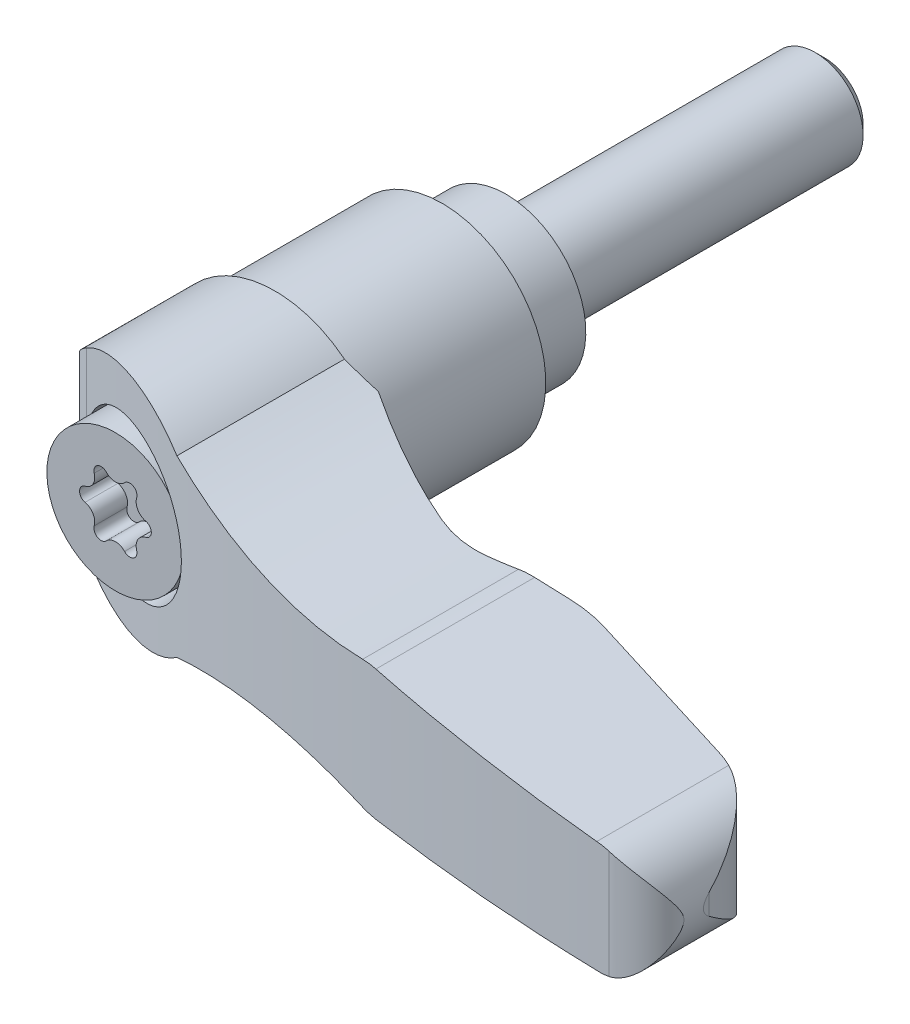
ISO-10303-21;
HEADER;
FILE_DESCRIPTION(('STEP AP214'),'2;1');
FILE_NAME('part.step','',(''),(''),'','','');
FILE_SCHEMA(('AUTOMOTIVE_DESIGN { 1 0 10303 214 1 1 1 1 }'));
ENDSEC;
DATA;
#1=APPLICATION_CONTEXT('core data for automotive mechanical design processes');
#2=APPLICATION_PROTOCOL_DEFINITION('international standard','automotive_design',2000,#1);
#3=PRODUCT_CONTEXT('',#1,'mechanical');
#4=PRODUCT('Part','Part','',(#3));
#5=PRODUCT_RELATED_PRODUCT_CATEGORY('part','',(#4));
#6=PRODUCT_DEFINITION_FORMATION('','',#4);
#7=PRODUCT_DEFINITION_CONTEXT('part definition',#1,'design');
#8=PRODUCT_DEFINITION('design','',#6,#7);
#9=PRODUCT_DEFINITION_SHAPE('','',#8);
#10=(LENGTH_UNIT() NAMED_UNIT(*) SI_UNIT(.MILLI.,.METRE.));
#11=(NAMED_UNIT(*) PLANE_ANGLE_UNIT() SI_UNIT($,.RADIAN.));
#12=(NAMED_UNIT(*) SI_UNIT($,.STERADIAN.) SOLID_ANGLE_UNIT());
#13=UNCERTAINTY_MEASURE_WITH_UNIT(LENGTH_MEASURE(1.E-05),#10,'distance_accuracy_value','');
#14=(GEOMETRIC_REPRESENTATION_CONTEXT(3) GLOBAL_UNCERTAINTY_ASSIGNED_CONTEXT((#13)) GLOBAL_UNIT_ASSIGNED_CONTEXT((#10,
#11,#12)) REPRESENTATION_CONTEXT('',''));
#15=CARTESIAN_POINT('',(0.,0.,0.));
#16=DIRECTION('',(0.,0.,1.));
#17=DIRECTION('',(1.,0.,0.));
#18=AXIS2_PLACEMENT_3D('',#15,#16,#17);
#19=CARTESIAN_POINT('',(0.,0.,-4.6928325));
#20=DIRECTION('',(0.,0.,-1.));
#21=DIRECTION('',(0.,1.,0.));
#22=AXIS2_PLACEMENT_3D('',#19,#20,#21);
#23=CYLINDRICAL_SURFACE('',#22,3.);
#24=CARTESIAN_POINT('',(0.,0.,-19.39));
#25=DIRECTION('',(0.,0.,-1.));
#26=DIRECTION('',(0.,1.,0.));
#27=AXIS2_PLACEMENT_3D('',#24,#25,#26);
#28=CIRCLE('',#27,3.);
#29=CARTESIAN_POINT('',(0.,3.,-19.39));
#30=VERTEX_POINT('',#29);
#31=EDGE_CURVE('E9',#30,#30,#28,.F.);
#32=ORIENTED_EDGE('',*,*,#31,.T.);
#33=EDGE_LOOP('',(#32));
#34=FACE_BOUND('',#33,.T.);
#35=CARTESIAN_POINT('',(0.,0.,0.));
#36=DIRECTION('',(0.,0.,-1.));
#37=DIRECTION('',(0.,1.,0.));
#38=AXIS2_PLACEMENT_3D('',#35,#36,#37);
#39=CIRCLE('',#38,3.);
#40=CARTESIAN_POINT('',(0.,3.,0.));
#41=VERTEX_POINT('',#40);
#42=EDGE_CURVE('E565',#41,#41,#39,.F.);
#43=ORIENTED_EDGE('',*,*,#42,.F.);
#44=EDGE_LOOP('',(#43));
#45=FACE_BOUND('',#44,.T.);
#46=ADVANCED_FACE('F14',(#34,#45),#23,.T.);
#47=CARTESIAN_POINT('',(4.,0.,0.));
#48=DIRECTION('',(0.,0.,-1.));
#49=DIRECTION('',(0.,1.,0.));
#50=AXIS2_PLACEMENT_3D('',#47,#48,#49);
#51=PLANE('',#50);
#52=ORIENTED_EDGE('',*,*,#42,.T.);
#53=EDGE_LOOP('',(#52));
#54=FACE_BOUND('',#53,.T.);
#55=CARTESIAN_POINT('',(0.,0.,0.));
#56=DIRECTION('',(0.,0.,-1.));
#57=DIRECTION('',(0.,1.,0.));
#58=AXIS2_PLACEMENT_3D('',#55,#56,#57);
#59=CIRCLE('',#58,5.);
#60=CARTESIAN_POINT('',(0.,5.,0.));
#61=VERTEX_POINT('',#60);
#62=EDGE_CURVE('E725',#61,#61,#59,.F.);
#63=ORIENTED_EDGE('',*,*,#62,.F.);
#64=EDGE_LOOP('',(#63));
#65=FACE_BOUND('',#64,.T.);
#66=ADVANCED_FACE('F668',(#54,#65),#51,.T.);
#67=CARTESIAN_POINT('',(0.,0.,6.4));
#68=DIRECTION('',(0.,0.,-1.));
#69=DIRECTION('',(0.,1.,0.));
#70=AXIS2_PLACEMENT_3D('',#67,#68,#69);
#71=CYLINDRICAL_SURFACE('',#70,5.);
#72=ORIENTED_EDGE('',*,*,#62,.T.);
#73=EDGE_LOOP('',(#72));
#74=FACE_BOUND('',#73,.T.);
#75=CARTESIAN_POINT('',(0.,0.,4.55000000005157));
#76=DIRECTION('',(0.,0.,-1.));
#77=DIRECTION('',(1.,0.,0.));
#78=AXIS2_PLACEMENT_3D('',#75,#76,#77);
#79=CIRCLE('',#78,4.99999999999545);
#80=CARTESIAN_POINT('',(4.99999999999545,0.,4.55000000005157));
#81=VERTEX_POINT('',#80);
#82=EDGE_CURVE('E558',#81,#81,#79,.T.);
#83=ORIENTED_EDGE('',*,*,#82,.T.);
#84=EDGE_LOOP('',(#83));
#85=FACE_BOUND('',#84,.T.);
#86=ADVANCED_FACE('F675',(#74,#85),#71,.T.);
#87=CARTESIAN_POINT('',(0.,0.,4.30000000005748));
#88=DIRECTION('',(0.,0.,-1.));
#89=DIRECTION('',(0.,1.,0.));
#90=AXIS2_PLACEMENT_3D('',#87,#88,#89);
#91=CONICAL_SURFACE('',#90,5.24999999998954,0.785398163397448);
#92=ORIENTED_EDGE('',*,*,#82,.F.);
#93=EDGE_LOOP('',(#92));
#94=FACE_BOUND('',#93,.T.);
#95=CARTESIAN_POINT('',(0.,0.,4.3));
#96=DIRECTION('',(0.,0.,-1.));
#97=DIRECTION('',(0.,1.,0.));
#98=AXIS2_PLACEMENT_3D('',#95,#96,#97);
#99=CIRCLE('',#98,5.25);
#100=CARTESIAN_POINT('',(0.,5.25,4.3));
#101=VERTEX_POINT('',#100);
#102=EDGE_CURVE('E554',#101,#101,#99,.T.);
#103=ORIENTED_EDGE('',*,*,#102,.T.);
#104=EDGE_LOOP('',(#103));
#105=FACE_BOUND('',#104,.T.);
#106=ADVANCED_FACE('F683',(#94,#105),#91,.F.);
#107=CARTESIAN_POINT('',(0.,0.,3.65));
#108=DIRECTION('',(0.,0.,-1.));
#109=DIRECTION('',(0.,1.,0.));
#110=AXIS2_PLACEMENT_3D('',#107,#108,#109);
#111=CYLINDRICAL_SURFACE('',#110,5.25);
#112=ORIENTED_EDGE('',*,*,#102,.F.);
#113=EDGE_LOOP('',(#112));
#114=FACE_BOUND('',#113,.T.);
#115=CARTESIAN_POINT('',(0.,0.,4.));
#116=DIRECTION('',(0.,0.,-1.));
#117=DIRECTION('',(0.,1.,0.));
#118=AXIS2_PLACEMENT_3D('',#115,#116,#117);
#119=CIRCLE('',#118,5.25);
#120=CARTESIAN_POINT('',(0.,5.25,4.));
#121=VERTEX_POINT('',#120);
#122=EDGE_CURVE('E713',#121,#121,#119,.F.);
#123=ORIENTED_EDGE('',*,*,#122,.F.);
#124=EDGE_LOOP('',(#123));
#125=FACE_BOUND('',#124,.T.);
#126=ADVANCED_FACE('F690',(#114,#125),#111,.F.);
#127=CARTESIAN_POINT('',(-6.36002265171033,-14.,4.));
#128=DIRECTION('',(0.707106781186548,0.,0.707106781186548));
#129=DIRECTION('',(-0.707106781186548,0.,0.707106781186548));
#130=AXIS2_PLACEMENT_3D('',#127,#128,#129);
#131=PLANE('',#130);
#132=DIRECTION('',(0.,1.,0.));
#133=VECTOR('',#132,1.);
#134=CARTESIAN_POINT('',(-6.36002265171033,0.,4.));
#135=LINE('',#134,#133);
#136=CARTESIAN_POINT('',(-6.36002265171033,-1.38824072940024,4.));
#137=VERTEX_POINT('',#136);
#138=CARTESIAN_POINT('',(-6.36002265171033,1.38824072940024,4.));
#139=VERTEX_POINT('',#138);
#140=EDGE_CURVE('E715',#137,#139,#135,.T.);
#141=ORIENTED_EDGE('',*,*,#140,.F.);
#142=CARTESIAN_POINT('',(-0.0100000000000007,0.,-2.35002265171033));
#143=DIRECTION('',(0.707106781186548,0.,0.707106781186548));
#144=DIRECTION('',(-0.707106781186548,0.,0.707106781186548));
#145=AXIS2_PLACEMENT_3D('',#142,#143,#144);
#146=ELLIPSE('',#145,9.19238815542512,6.5);
#147=EDGE_CURVE('E557',#139,#137,#146,.T.);
#148=ORIENTED_EDGE('',*,*,#147,.F.);
#149=EDGE_LOOP('',(#141,#148));
#150=FACE_BOUND('',#149,.T.);
#151=ADVANCED_FACE('F694',(#150),#131,.F.);
#152=CARTESIAN_POINT('',(-3.26,0.,4.));
#153=DIRECTION('',(0.,0.,-1.));
#154=DIRECTION('',(0.,1.,0.));
#155=AXIS2_PLACEMENT_3D('',#152,#153,#154);
#156=PLANE('',#155);
#157=CARTESIAN_POINT('',(-0.00999999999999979,0.,4.));
#158=DIRECTION('',(0.,0.,1.));
#159=DIRECTION('',(-1.,0.,0.));
#160=AXIS2_PLACEMENT_3D('',#157,#158,#159);
#161=CIRCLE('',#160,6.5);
#162=EDGE_CURVE('E709',#137,#139,#161,.T.);
#163=ORIENTED_EDGE('',*,*,#162,.F.);
#164=ORIENTED_EDGE('',*,*,#140,.T.);
#165=EDGE_LOOP('',(#163,#164));
#166=FACE_BOUND('',#165,.T.);
#167=ORIENTED_EDGE('',*,*,#122,.T.);
#168=EDGE_LOOP('',(#167));
#169=FACE_BOUND('',#168,.T.);
#170=ADVANCED_FACE('F697',(#166,#169),#156,.T.);
#171=CARTESIAN_POINT('',(39.9389658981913,-8.,27.2042491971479));
#172=DIRECTION('',(0.989626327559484,0.,-0.143665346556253));
#173=DIRECTION('',(0.143665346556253,0.,0.989626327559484));
#174=AXIS2_PLACEMENT_3D('',#171,#172,#173);
#175=PLANE('',#174);
#176=CARTESIAN_POINT('',(36.5,0.,3.51522972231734));
#177=DIRECTION('',(0.989626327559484,0.,-0.143665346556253));
#178=DIRECTION('',(0.143665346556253,0.,0.989626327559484));
#179=AXIS2_PLACEMENT_3D('',#176,#177,#178);
#180=ELLIPSE('',#179,24.3621728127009,3.5);
#181=CARTESIAN_POINT('',(39.9389658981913,-0.650779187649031,27.2042491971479));
#182=VERTEX_POINT('',#181);
#183=CARTESIAN_POINT('',(39.9389658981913,0.650779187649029,27.2042491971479));
#184=VERTEX_POINT('',#183);
#185=EDGE_CURVE('E461',#182,#184,#180,.F.);
#186=ORIENTED_EDGE('',*,*,#185,.F.);
#187=DIRECTION('',(0.,-1.,0.));
#188=VECTOR('',#187,1.);
#189=CARTESIAN_POINT('',(39.9389658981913,-8.,27.2042491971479));
#190=LINE('',#189,#188);
#191=EDGE_CURVE('E848',#184,#182,#190,.T.);
#192=ORIENTED_EDGE('',*,*,#191,.F.);
#193=EDGE_LOOP('',(#186,#192));
#194=FACE_BOUND('',#193,.T.);
#195=ADVANCED_FACE('F485',(#194),#175,.T.);
#196=CARTESIAN_POINT('',(33.8626602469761,-8.,28.0863544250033));
#197=DIRECTION('',(0.,-1.,0.));
#198=DIRECTION('',(1.,0.,0.));
#199=AXIS2_PLACEMENT_3D('',#196,#197,#198);
#200=CYLINDRICAL_SURFACE('',#199,6.14);
#201=ORIENTED_EDGE('',*,*,#191,.T.);
#202=CARTESIAN_POINT('',(36.5,-3.5,22.5416236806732));
#203=CARTESIAN_POINT('',(36.6061539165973,-3.50000941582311,22.5920863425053));
#204=CARTESIAN_POINT('',(36.7107657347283,-3.49517280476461,22.6456099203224));
#205=CARTESIAN_POINT('',(36.9160027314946,-3.47671082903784,22.758101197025));
#206=CARTESIAN_POINT('',(37.0166343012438,-3.46310021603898,22.8170596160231));
#207=CARTESIAN_POINT('',(37.2123479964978,-3.42816986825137,22.9392782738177));
#208=CARTESIAN_POINT('',(37.3074768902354,-3.40693163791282,23.002487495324));
#209=CARTESIAN_POINT('',(37.4929223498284,-3.3575759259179,23.13320682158));
#210=CARTESIAN_POINT('',(37.5832363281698,-3.32945478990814,23.2007191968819));
#211=CARTESIAN_POINT('',(37.7830795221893,-3.25850520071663,23.358740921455));
#212=CARTESIAN_POINT('',(37.8909927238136,-3.21376078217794,23.4504360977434));
#213=CARTESIAN_POINT('',(38.0982482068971,-3.11588681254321,23.6389903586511));
#214=CARTESIAN_POINT('',(38.1975840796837,-3.06275107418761,23.7358532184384));
#215=CARTESIAN_POINT('',(38.3880468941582,-2.94917464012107,23.9343090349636));
#216=CARTESIAN_POINT('',(38.4791322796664,-2.88870020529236,24.0359224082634));
#217=CARTESIAN_POINT('',(38.6526412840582,-2.76182607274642,24.2426721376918));
#218=CARTESIAN_POINT('',(38.7350674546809,-2.69542813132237,24.3478074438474));
#219=CARTESIAN_POINT('',(38.9229341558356,-2.52996933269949,24.6038856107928));
#220=CARTESIAN_POINT('',(39.0243159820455,-2.42850340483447,24.7562617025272));
#221=CARTESIAN_POINT('',(39.2111706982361,-2.21796613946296,25.0654781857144));
#222=CARTESIAN_POINT('',(39.2966363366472,-2.10889136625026,25.2223205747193));
#223=CARTESIAN_POINT('',(39.452222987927,-1.88493092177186,25.5392893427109));
#224=CARTESIAN_POINT('',(39.5223498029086,-1.77004746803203,25.699414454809));
#225=CARTESIAN_POINT('',(39.6478320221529,-1.53583460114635,26.0220530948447));
#226=CARTESIAN_POINT('',(39.7031929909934,-1.41650688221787,26.1845656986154));
#227=CARTESIAN_POINT('',(39.7933776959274,-1.1901857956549,26.4900634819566));
#228=CARTESIAN_POINT('',(39.8299343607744,-1.08360162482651,26.6328455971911));
#229=CARTESIAN_POINT('',(39.8923391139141,-0.86858691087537,26.918504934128));
#230=CARTESIAN_POINT('',(39.918226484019,-0.76016469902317,27.0613798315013));
#231=CARTESIAN_POINT('',(39.9389658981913,-0.650779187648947,27.204249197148));
#232=B_SPLINE_CURVE_WITH_KNOTS('',3,(#202,#203,#204,#205,#206,#207,#208,#209,#210,#211,#212,
#213,#214,#215,#216,#217,#218,#219,#220,#221,#222,#223,#224,#225,#226,#227,#228,#229,#230,#231),
.UNSPECIFIED.,.F.,.F.,(4,2,2,2,2,2,2,2,2,2,2,2,2,2,4),(0.,0.352350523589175,0.704110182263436,
1.05221781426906,1.40051067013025,1.84538152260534,2.29058194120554,2.73791274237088,
3.18511134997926,3.81198117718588,4.43913591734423,5.06605301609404,5.69273352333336,
6.23807905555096,6.78139842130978),.UNSPECIFIED.);
#233=CARTESIAN_POINT('',(36.5,-3.5,22.5416236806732));
#234=VERTEX_POINT('',#233);
#235=EDGE_CURVE('E465',#234,#182,#232,.T.);
#236=ORIENTED_EDGE('',*,*,#235,.F.);
#237=CARTESIAN_POINT('',(33.8626602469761,-3.59762871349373,28.0863544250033));
#238=DIRECTION('',(-0.0369925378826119,0.999315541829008,0.));
#239=DIRECTION('',(-0.999315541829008,-0.0369925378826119,0.));
#240=AXIS2_PLACEMENT_3D('',#237,#238,#239);
#241=ELLIPSE('',#240,6.14420545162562,6.14);
#242=CARTESIAN_POINT('',(35.5344609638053,-3.53574220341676,22.1783359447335));
#243=VERTEX_POINT('',#242);
#244=EDGE_CURVE('E717',#234,#243,#241,.T.);
#245=ORIENTED_EDGE('',*,*,#244,.T.);
#246=DIRECTION('',(0.,-1.,0.));
#247=VECTOR('',#246,1.);
#248=CARTESIAN_POINT('',(35.5344609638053,-8.,22.1783359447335));
#249=LINE('',#248,#247);
#250=CARTESIAN_POINT('',(35.5344609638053,3.53574220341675,22.1783359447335));
#251=VERTEX_POINT('',#250);
#252=EDGE_CURVE('E539',#251,#243,#249,.T.);
#253=ORIENTED_EDGE('',*,*,#252,.F.);
#254=CARTESIAN_POINT('',(33.8626602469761,3.59762871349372,28.0863544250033));
#255=DIRECTION('',(-0.036992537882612,-0.999315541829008,0.));
#256=DIRECTION('',(0.999315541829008,-0.036992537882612,0.));
#257=AXIS2_PLACEMENT_3D('',#254,#255,#256);
#258=ELLIPSE('',#257,6.14420545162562,6.14);
#259=CARTESIAN_POINT('',(36.5,3.5,22.5416236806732));
#260=VERTEX_POINT('',#259);
#261=EDGE_CURVE('E847',#251,#260,#258,.T.);
#262=ORIENTED_EDGE('',*,*,#261,.T.);
#263=CARTESIAN_POINT('',(39.9389658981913,0.65077918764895,27.204249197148));
#264=CARTESIAN_POINT('',(39.9247028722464,0.726086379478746,27.1059853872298));
#265=CARTESIAN_POINT('',(39.9079968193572,0.800887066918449,27.0076860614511));
#266=CARTESIAN_POINT('',(39.8696347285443,0.949458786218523,26.8112602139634));
#267=CARTESIAN_POINT('',(39.8479781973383,1.02322971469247,26.7131337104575));
#268=CARTESIAN_POINT('',(39.7995979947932,1.169880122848,26.5170899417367));
#269=CARTESIAN_POINT('',(39.7728626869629,1.24275713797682,26.4191736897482));
#270=CARTESIAN_POINT('',(39.7142815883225,1.38725410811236,26.2239599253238));
#271=CARTESIAN_POINT('',(39.6824358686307,1.4588740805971,26.1266624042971));
#272=CARTESIAN_POINT('',(39.5782917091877,1.67318502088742,25.8337016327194));
#273=CARTESIAN_POINT('',(39.4979263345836,1.81366367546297,25.6391889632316));
#274=CARTESIAN_POINT('',(39.3150854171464,2.08619457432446,25.2551202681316));
#275=CARTESIAN_POINT('',(39.2126344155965,2.218255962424,25.0655590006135));
#276=CARTESIAN_POINT('',(38.9595027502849,2.49877334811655,24.6523338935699));
#277=CARTESIAN_POINT('',(38.8031801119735,2.64456339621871,24.4302018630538));
#278=CARTESIAN_POINT('',(38.5417124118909,2.84488994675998,24.1082756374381));
#279=CARTESIAN_POINT('',(38.4501831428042,2.90854134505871,24.0029632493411));
#280=CARTESIAN_POINT('',(38.2579442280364,3.02861213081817,23.7967186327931));
#281=CARTESIAN_POINT('',(38.1572360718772,3.08503268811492,23.6957856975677));
#282=CARTESIAN_POINT('',(37.8892625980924,3.21757634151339,23.4457323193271));
#283=CARTESIAN_POINT('',(37.7155213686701,3.28779061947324,23.3001643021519));
#284=CARTESIAN_POINT('',(37.4396992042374,3.37286339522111,23.0946053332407));
#285=CARTESIAN_POINT('',(37.3453175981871,3.39783246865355,23.0282732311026));
#286=CARTESIAN_POINT('',(37.1517842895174,3.44019984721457,22.9003457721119));
#287=CARTESIAN_POINT('',(37.0526354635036,3.45760265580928,22.8387476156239));
#288=CARTESIAN_POINT('',(36.8781783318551,3.48029211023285,22.7372021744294));
#289=CARTESIAN_POINT('',(36.8038676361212,3.48759914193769,22.6959814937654));
#290=CARTESIAN_POINT('',(36.6533047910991,3.497455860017,22.6165121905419));
#291=CARTESIAN_POINT('',(36.5770513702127,3.50000234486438,22.5782655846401));
#292=CARTESIAN_POINT('',(36.5,3.5,22.5416236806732));
#293=B_SPLINE_CURVE_WITH_KNOTS('',3,(#263,#264,#265,#266,#267,#268,#269,#270,#271,#272,#273,
#274,#275,#276,#277,#278,#279,#280,#281,#282,#283,#284,#285,#286,#287,#288,#289,#290,#291,#292),
.UNSPECIFIED.,.F.,.F.,(4,2,2,2,2,2,2,2,2,2,2,2,2,2,4),(0.,0.373839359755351,0.747715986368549,
1.12245980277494,1.49719840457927,2.25512351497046,3.01221072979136,3.93367725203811,
4.39332639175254,4.85290107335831,5.56171222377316,5.91546495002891,6.26900683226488,
6.52468766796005,6.78054039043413),.UNSPECIFIED.);
#294=EDGE_CURVE('E434',#184,#260,#293,.T.);
#295=ORIENTED_EDGE('',*,*,#294,.F.);
#296=EDGE_LOOP('',(#201,#236,#245,#253,#262,#295));
#297=FACE_BOUND('',#296,.T.);
#298=ADVANCED_FACE('F479',(#297),#200,.T.);
#299=CARTESIAN_POINT('',(-0.0099999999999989,0.,10.28125));
#300=DIRECTION('',(0.,0.,1.));
#301=DIRECTION('',(-1.,0.,0.));
#302=AXIS2_PLACEMENT_3D('',#299,#300,#301);
#303=CYLINDRICAL_SURFACE('',#302,6.5);
#304=CARTESIAN_POINT('',(-0.00999999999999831,0.,14.5));
#305=DIRECTION('',(0.,0.,1.));
#306=DIRECTION('',(-1.,0.,0.));
#307=AXIS2_PLACEMENT_3D('',#304,#305,#306);
#308=CIRCLE('',#307,6.5);
#309=CARTESIAN_POINT('',(-6.51,0.,14.5));
#310=VERTEX_POINT('',#309);
#311=CARTESIAN_POINT('',(6.49,0.,14.5));
#312=VERTEX_POINT('',#311);
#313=EDGE_CURVE('E850',#310,#312,#308,.T.);
#314=ORIENTED_EDGE('',*,*,#313,.F.);
#315=CARTESIAN_POINT('',(-0.00999999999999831,0.,14.5));
#316=DIRECTION('',(0.,0.,1.));
#317=DIRECTION('',(-1.,0.,0.));
#318=AXIS2_PLACEMENT_3D('',#315,#316,#317);
#319=CIRCLE('',#318,6.5);
#320=EDGE_CURVE('E536',#312,#310,#319,.T.);
#321=ORIENTED_EDGE('',*,*,#320,.F.);
#322=EDGE_LOOP('',(#314,#321));
#323=FACE_BOUND('',#322,.T.);
#324=ORIENTED_EDGE('',*,*,#162,.T.);
#325=ORIENTED_EDGE('',*,*,#147,.T.);
#326=EDGE_LOOP('',(#324,#325));
#327=FACE_BOUND('',#326,.T.);
#328=ADVANCED_FACE('F484',(#323,#327),#303,.T.);
#329=CARTESIAN_POINT('',(-6.51,-8.,14.5));
#330=DIRECTION('',(0.,0.,-1.));
#331=DIRECTION('',(0.,1.,0.));
#332=AXIS2_PLACEMENT_3D('',#329,#330,#331);
#333=PLANE('',#332);
#334=ORIENTED_EDGE('',*,*,#313,.T.);
#335=DIRECTION('',(0.,-1.,0.));
#336=VECTOR('',#335,1.);
#337=CARTESIAN_POINT('',(6.49,-8.,14.5));
#338=LINE('',#337,#336);
#339=CARTESIAN_POINT('',(6.49,-4.77390244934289,14.5));
#340=VERTEX_POINT('',#339);
#341=EDGE_CURVE('E853',#312,#340,#338,.T.);
#342=ORIENTED_EDGE('',*,*,#341,.T.);
#343=CARTESIAN_POINT('',(14.8,-33.6,14.5));
#344=DIRECTION('',(0.,0.,1.));
#345=DIRECTION('',(0.,-1.,0.));
#346=AXIS2_PLACEMENT_3D('',#343,#344,#345);
#347=CIRCLE('',#346,30.);
#348=CARTESIAN_POINT('',(4.36278582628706,-5.47413005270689,14.5));
#349=VERTEX_POINT('',#348);
#350=EDGE_CURVE('E810',#340,#349,#347,.T.);
#351=ORIENTED_EDGE('',*,*,#350,.T.);
#352=CARTESIAN_POINT('',(0.,0.,14.5));
#353=DIRECTION('',(0.,0.,1.));
#354=DIRECTION('',(0.,-1.,0.));
#355=AXIS2_PLACEMENT_3D('',#352,#353,#354);
#356=CIRCLE('',#355,7.);
#357=CARTESIAN_POINT('',(-6.51,-2.57291663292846,14.5));
#358=VERTEX_POINT('',#357);
#359=EDGE_CURVE('E372',#358,#349,#356,.T.);
#360=ORIENTED_EDGE('',*,*,#359,.F.);
#361=DIRECTION('',(0.,-1.,0.));
#362=VECTOR('',#361,1.);
#363=CARTESIAN_POINT('',(-6.51,-8.,14.5));
#364=LINE('',#363,#362);
#365=EDGE_CURVE('E535',#310,#358,#364,.T.);
#366=ORIENTED_EDGE('',*,*,#365,.F.);
#367=EDGE_LOOP('',(#334,#342,#351,#360,#366));
#368=FACE_BOUND('',#367,.T.);
#369=ADVANCED_FACE('F490',(#368),#333,.T.);
#370=CARTESIAN_POINT('',(20.6060580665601,0.915064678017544,31.));
#371=DIRECTION('',(0.,0.,1.));
#372=DIRECTION('',(0.,-1.,0.));
#373=AXIS2_PLACEMENT_3D('',#370,#371,#372);
#374=CYLINDRICAL_SURFACE('',#373,5.);
#375=CARTESIAN_POINT('',(20.7910207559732,-4.08151303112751,28.9575923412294));
#376=CARTESIAN_POINT('',(20.6207575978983,-4.08776311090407,28.9275070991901));
#377=CARTESIAN_POINT('',(20.4510927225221,-4.08540030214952,28.8972050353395));
#378=CARTESIAN_POINT('',(20.1129595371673,-4.06344890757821,28.8361672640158));
#379=CARTESIAN_POINT('',(19.9444912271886,-4.04386032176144,28.8054315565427));
#380=CARTESIAN_POINT('',(19.7766211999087,-4.01565884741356,28.7744790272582));
#381=B_SPLINE_CURVE_WITH_KNOTS('',3,(#375,#376,#377,#378,#379,#380),.UNSPECIFIED.,.F.,.F.,(4,2,
4),(0.,0.517097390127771,1.03419478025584),.UNSPECIFIED.);
#382=CARTESIAN_POINT('',(20.7910207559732,-4.08151303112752,28.9575923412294));
#383=VERTEX_POINT('',#382);
#384=CARTESIAN_POINT('',(19.7766211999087,-4.01565884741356,28.7744790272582));
#385=VERTEX_POINT('',#384);
#386=EDGE_CURVE('E468',#383,#385,#381,.T.);
#387=ORIENTED_EDGE('',*,*,#386,.T.);
#388=DIRECTION('',(0.,0.,1.));
#389=VECTOR('',#388,1.);
#390=CARTESIAN_POINT('',(19.7766211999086,-4.01565884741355,31.));
#391=LINE('',#390,#389);
#392=CARTESIAN_POINT('',(19.7766211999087,-4.01565884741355,19.));
#393=VERTEX_POINT('',#392);
#394=EDGE_CURVE('E803',#385,#393,#391,.F.);
#395=ORIENTED_EDGE('',*,*,#394,.T.);
#396=CARTESIAN_POINT('',(20.6060580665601,0.915064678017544,19.));
#397=DIRECTION('',(0.,0.,1.));
#398=DIRECTION('',(0.,-1.,0.));
#399=AXIS2_PLACEMENT_3D('',#396,#397,#398);
#400=CIRCLE('',#399,5.);
#401=CARTESIAN_POINT('',(20.7910207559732,-4.08151303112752,19.));
#402=VERTEX_POINT('',#401);
#403=EDGE_CURVE('E857',#402,#393,#400,.F.);
#404=ORIENTED_EDGE('',*,*,#403,.F.);
#405=DIRECTION('',(0.,0.,1.));
#406=VECTOR('',#405,1.);
#407=CARTESIAN_POINT('',(20.7910207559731,-4.08151303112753,31.));
#408=LINE('',#407,#406);
#409=EDGE_CURVE('E809',#402,#383,#408,.T.);
#410=ORIENTED_EDGE('',*,*,#409,.T.);
#411=EDGE_LOOP('',(#387,#395,#404,#410));
#412=FACE_BOUND('',#411,.T.);
#413=ADVANCED_FACE('F426',(#412),#374,.T.);
#414=CARTESIAN_POINT('',(36.5,0.,31.));
#415=DIRECTION('',(0.,0.,1.));
#416=DIRECTION('',(0.,-1.,0.));
#417=AXIS2_PLACEMENT_3D('',#414,#415,#416);
#418=CYLINDRICAL_SURFACE('',#417,3.5);
#419=CARTESIAN_POINT('',(37.3240183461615,-3.40161634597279,30.8631619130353));
#420=CARTESIAN_POINT('',(37.188603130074,-3.43435641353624,30.8557619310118));
#421=CARTESIAN_POINT('',(37.0522273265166,-3.45892508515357,30.8481012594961));
#422=CARTESIAN_POINT('',(36.7775545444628,-3.49171963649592,30.8322585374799));
#423=CARTESIAN_POINT('',(36.6392575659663,-3.499945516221,30.8240764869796));
#424=CARTESIAN_POINT('',(36.5,-3.5,30.815633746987));
#425=B_SPLINE_CURVE_WITH_KNOTS('',3,(#419,#420,#421,#422,#423,#424),.UNSPECIFIED.,.F.,.F.,(4,2,
4),(0.,0.416348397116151,0.832696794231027),.UNSPECIFIED.);
#426=CARTESIAN_POINT('',(37.3240183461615,-3.40161634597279,30.8631619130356));
#427=VERTEX_POINT('',#426);
#428=CARTESIAN_POINT('',(36.5,-3.5,30.815633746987));
#429=VERTEX_POINT('',#428);
#430=EDGE_CURVE('E446',#427,#429,#425,.T.);
#431=ORIENTED_EDGE('',*,*,#430,.T.);
#432=DIRECTION('',(0.,0.,1.));
#433=VECTOR('',#432,1.);
#434=CARTESIAN_POINT('',(36.5,-3.5,31.));
#435=LINE('',#434,#433);
#436=EDGE_CURVE('E820',#429,#234,#435,.F.);
#437=ORIENTED_EDGE('',*,*,#436,.T.);
#438=ORIENTED_EDGE('',*,*,#235,.T.);
#439=ORIENTED_EDGE('',*,*,#185,.T.);
#440=ORIENTED_EDGE('',*,*,#294,.T.);
#441=DIRECTION('',(0.,0.,1.));
#442=VECTOR('',#441,1.);
#443=CARTESIAN_POINT('',(36.5,3.5,31.));
#444=LINE('',#443,#442);
#445=CARTESIAN_POINT('',(36.5,3.5,30.815633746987));
#446=VERTEX_POINT('',#445);
#447=EDGE_CURVE('E414',#260,#446,#444,.T.);
#448=ORIENTED_EDGE('',*,*,#447,.T.);
#449=CARTESIAN_POINT('',(36.5,3.5,30.815633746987));
#450=CARTESIAN_POINT('',(36.6392575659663,3.499945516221,30.8240764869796));
#451=CARTESIAN_POINT('',(36.7775545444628,3.49171963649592,30.8322585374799));
#452=CARTESIAN_POINT('',(37.0522273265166,3.45892508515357,30.8481012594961));
#453=CARTESIAN_POINT('',(37.188603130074,3.43435641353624,30.8557619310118));
#454=CARTESIAN_POINT('',(37.3240183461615,3.40161634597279,30.8631619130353));
#455=B_SPLINE_CURVE_WITH_KNOTS('',3,(#449,#450,#451,#452,#453,#454),.UNSPECIFIED.,.F.,.F.,(4,2,
4),(0.,0.416348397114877,0.832696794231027),.UNSPECIFIED.);
#456=CARTESIAN_POINT('',(37.3240183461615,3.40161634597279,30.8631619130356));
#457=VERTEX_POINT('',#456);
#458=EDGE_CURVE('E452',#446,#457,#455,.T.);
#459=ORIENTED_EDGE('',*,*,#458,.T.);
#460=CARTESIAN_POINT('',(37.3240183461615,-3.40161634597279,30.8631619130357));
#461=CARTESIAN_POINT('',(37.391971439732,-3.38517327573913,30.8668921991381));
#462=CARTESIAN_POINT('',(37.4595366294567,-3.36663320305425,30.8678982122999));
#463=CARTESIAN_POINT('',(37.5932555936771,-3.32560440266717,30.8647814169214));
#464=CARTESIAN_POINT('',(37.6594109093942,-3.30312026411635,30.8606645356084));
#465=CARTESIAN_POINT('',(37.7892420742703,-3.25463078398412,30.8476880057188));
#466=CARTESIAN_POINT('',(37.8529349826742,-3.22865926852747,30.8388717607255));
#467=CARTESIAN_POINT('',(37.9780608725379,-3.17332967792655,30.8169101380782));
#468=CARTESIAN_POINT('',(38.0394932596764,-3.14397072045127,30.8037636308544));
#469=CARTESIAN_POINT('',(38.2193405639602,-3.05154774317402,30.7585650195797));
#470=CARTESIAN_POINT('',(38.3339861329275,-2.98387991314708,30.7206782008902));
#471=CARTESIAN_POINT('',(38.5517467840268,-2.83858348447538,30.6324207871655));
#472=CARTESIAN_POINT('',(38.6548343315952,-2.76093200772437,30.5820212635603));
#473=CARTESIAN_POINT('',(38.8266237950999,-2.61655584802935,30.4842690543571));
#474=CARTESIAN_POINT('',(38.8977926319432,-2.55140368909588,30.4388637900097));
#475=CARTESIAN_POINT('',(39.0330318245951,-2.41719472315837,30.3433991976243));
#476=CARTESIAN_POINT('',(39.0970985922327,-2.34813596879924,30.2933375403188));
#477=CARTESIAN_POINT('',(39.2184581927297,-2.20651617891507,30.1893556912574));
#478=CARTESIAN_POINT('',(39.2757265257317,-2.13394372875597,30.1354226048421));
#479=CARTESIAN_POINT('',(39.3834200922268,-1.9860149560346,30.0247265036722));
#480=CARTESIAN_POINT('',(39.4338475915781,-1.91065956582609,29.9679644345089));
#481=CARTESIAN_POINT('',(39.542421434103,-1.73419420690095,29.8348143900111));
#482=CARTESIAN_POINT('',(39.598263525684,-1.63221056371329,29.7576996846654));
#483=CARTESIAN_POINT('',(39.699250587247,-1.42414609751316,29.601672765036));
#484=CARTESIAN_POINT('',(39.7443776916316,-1.31805876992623,29.5227577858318));
#485=CARTESIAN_POINT('',(39.8239747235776,-1.10201279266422,29.3659397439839));
#486=CARTESIAN_POINT('',(39.8584944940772,-0.992075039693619,29.2880336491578));
#487=CARTESIAN_POINT('',(39.9024720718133,-0.82253324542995,29.1754655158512));
#488=CARTESIAN_POINT('',(39.9158188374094,-0.765322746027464,29.13870216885));
#489=CARTESIAN_POINT('',(39.9398686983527,-0.648731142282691,29.0678855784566));
#490=CARTESIAN_POINT('',(39.9505741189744,-0.589352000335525,29.0338299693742));
#491=CARTESIAN_POINT('',(39.9677206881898,-0.477086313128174,28.9756719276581));
#492=CARTESIAN_POINT('',(39.974567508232,-0.424644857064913,28.9508463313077));
#493=CARTESIAN_POINT('',(39.9860225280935,-0.317100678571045,28.907341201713));
#494=CARTESIAN_POINT('',(39.9906385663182,-0.262008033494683,28.8886402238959));
#495=CARTESIAN_POINT('',(39.9966232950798,-0.160247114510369,28.8637621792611));
#496=CARTESIAN_POINT('',(39.9984523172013,-0.114054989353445,28.8558445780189));
#497=CARTESIAN_POINT('',(40.0002450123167,-0.0209847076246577,28.8480882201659));
#498=CARTESIAN_POINT('',(40.0002117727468,0.0258921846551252,28.8482360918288));
#499=CARTESIAN_POINT('',(39.9982952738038,0.118672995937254,28.8565205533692));
#500=CARTESIAN_POINT('',(39.9964185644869,0.164579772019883,28.8646288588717));
#501=CARTESIAN_POINT('',(39.9910078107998,0.254792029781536,28.8870889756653));
#502=CARTESIAN_POINT('',(39.9874686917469,0.299092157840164,28.9014598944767));
#503=CARTESIAN_POINT('',(39.9768286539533,0.407331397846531,28.9425912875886));
#504=CARTESIAN_POINT('',(39.9688318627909,0.470155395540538,28.9719647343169));
#505=CARTESIAN_POINT('',(39.9499914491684,0.592804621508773,29.0357410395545));
#506=CARTESIAN_POINT('',(39.9391403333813,0.652621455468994,29.0701570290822));
#507=CARTESIAN_POINT('',(39.9146680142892,0.770512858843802,29.1419527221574));
#508=CARTESIAN_POINT('',(39.9010255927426,0.828569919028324,29.1793537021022));
#509=CARTESIAN_POINT('',(39.8711029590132,0.942947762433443,29.2555520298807));
#510=CARTESIAN_POINT('',(39.8548256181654,0.999270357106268,29.2943478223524));
#511=CARTESIAN_POINT('',(39.8016739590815,1.1674299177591,29.4125134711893));
#512=CARTESIAN_POINT('',(39.7607265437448,1.27728939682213,29.4929030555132));
#513=CARTESIAN_POINT('',(39.6677865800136,1.49294867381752,29.6529500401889));
#514=CARTESIAN_POINT('',(39.6157834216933,1.59874445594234,29.7326066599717));
#515=CARTESIAN_POINT('',(39.5005966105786,1.80564912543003,29.8886982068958));
#516=CARTESIAN_POINT('',(39.4374685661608,1.90677830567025,29.9651469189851));
#517=CARTESIAN_POINT('',(39.2994325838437,2.10420227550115,30.1133265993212));
#518=CARTESIAN_POINT('',(39.2245348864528,2.20050117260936,30.1850615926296));
#519=CARTESIAN_POINT('',(39.0442952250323,2.40820732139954,30.3372677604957));
#520=CARTESIAN_POINT('',(38.9358891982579,2.51819093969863,30.4161164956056));
#521=CARTESIAN_POINT('',(38.7000552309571,2.72661786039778,30.559662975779));
#522=CARTESIAN_POINT('',(38.5726400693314,2.82506883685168,30.6243701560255));
#523=CARTESIAN_POINT('',(38.3254291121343,2.98922527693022,30.7237895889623));
#524=CARTESIAN_POINT('',(38.2087731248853,3.05759969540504,30.7618633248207));
#525=CARTESIAN_POINT('',(37.9650872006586,3.18151973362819,30.8217517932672));
#526=CARTESIAN_POINT('',(37.8380870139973,3.23710049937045,30.8436114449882));
#527=CARTESIAN_POINT('',(37.6449762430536,3.3080955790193,30.8616374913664));
#528=CARTESIAN_POINT('',(37.5816159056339,3.32934954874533,30.8652564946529));
#529=CARTESIAN_POINT('',(37.4536360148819,3.36824327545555,30.867801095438));
#530=CARTESIAN_POINT('',(37.389015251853,3.38587935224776,30.8667219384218));
#531=CARTESIAN_POINT('',(37.3240183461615,3.40161634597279,30.8631619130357));
#532=B_SPLINE_CURVE_WITH_KNOTS('',3,(#460,#461,#462,#463,#464,#465,#466,#467,#468,#469,#470,
#471,#472,#473,#474,#475,#476,#477,#478,#479,#480,#481,#482,#483,#484,#485,#486,#487,#488,#489,
#490,#491,#492,#493,#494,#495,#496,#497,#498,#499,#500,#501,#502,#503,#504,#505,#506,#507,#508,
#509,#510,#511,#512,#513,#514,#515,#516,#517,#518,#519,#520,#521,#522,#523,#524,#525,#526,#527,
#528,#529,#530,#531),.UNSPECIFIED.,.F.,.F.,(4,2,2,2,2,2,2,2,2,2,2,2,2,2,2,2,2,2,2,2,2,2,2,2,2,2,
2,2,2,2,2,2,2,2,2,4),(0.,0.20991378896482,0.419584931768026,0.62735226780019,0.83517384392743,
1.2486492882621,1.66308971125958,1.98257890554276,2.30222878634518,2.62299771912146,
2.94366014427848,3.36167065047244,3.78037330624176,4.19707731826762,4.40489951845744,
4.61253810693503,4.78756393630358,4.9619702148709,5.10204921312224,5.24189598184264,
5.38124764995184,5.52102749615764,5.72989301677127,5.9393124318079,6.15038720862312,
6.36123350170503,6.7871576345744,7.21349237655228,7.63775356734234,8.06164764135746,
8.58013018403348,9.09826573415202,9.51811060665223,9.9367879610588,10.1373304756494,
10.3380759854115),.UNSPECIFIED.);
#533=EDGE_CURVE('E406',#427,#457,#532,.T.);
#534=ORIENTED_EDGE('',*,*,#533,.F.);
#535=EDGE_LOOP('',(#431,#437,#438,#439,#440,#448,#459,#534));
#536=FACE_BOUND('',#535,.T.);
#537=ADVANCED_FACE('F420',(#536),#418,.T.);
#538=CARTESIAN_POINT('',(23.0466685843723,-8.,28.05));
#539=DIRECTION('',(0.,-1.,0.));
#540=DIRECTION('',(1.,0.,0.));
#541=AXIS2_PLACEMENT_3D('',#538,#539,#540);
#542=CYLINDRICAL_SURFACE('',#541,9.05000000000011);
#543=CARTESIAN_POINT('',(23.0466685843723,3.99801374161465,28.05));
#544=DIRECTION('',(-0.036992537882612,-0.999315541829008,0.));
#545=DIRECTION('',(0.999315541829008,-0.036992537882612,0.));
#546=AXIS2_PLACEMENT_3D('',#543,#544,#545);
#547=ELLIPSE('',#546,9.05619858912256,9.05000000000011);
#548=CARTESIAN_POINT('',(23.0466685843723,3.99801374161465,19.));
#549=VERTEX_POINT('',#548);
#550=CARTESIAN_POINT('',(25.5108048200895,3.90679665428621,19.34192715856));
#551=VERTEX_POINT('',#550);
#552=EDGE_CURVE('E402',#549,#551,#547,.T.);
#553=ORIENTED_EDGE('',*,*,#552,.T.);
#554=DIRECTION('',(0.,-1.,0.));
#555=VECTOR('',#554,1.);
#556=CARTESIAN_POINT('',(25.5108048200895,-8.,19.34192715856));
#557=LINE('',#556,#555);
#558=CARTESIAN_POINT('',(25.5108048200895,-3.90679665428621,19.34192715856));
#559=VERTEX_POINT('',#558);
#560=EDGE_CURVE('E459',#559,#551,#557,.F.);
#561=ORIENTED_EDGE('',*,*,#560,.F.);
#562=CARTESIAN_POINT('',(23.0466685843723,-3.99801374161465,28.05));
#563=DIRECTION('',(-0.0369925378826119,0.999315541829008,0.));
#564=DIRECTION('',(-0.999315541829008,-0.0369925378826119,0.));
#565=AXIS2_PLACEMENT_3D('',#562,#563,#564);
#566=ELLIPSE('',#565,9.05619858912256,9.05000000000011);
#567=CARTESIAN_POINT('',(23.0466685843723,-3.99801374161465,19.));
#568=VERTEX_POINT('',#567);
#569=EDGE_CURVE('E416',#559,#568,#566,.T.);
#570=ORIENTED_EDGE('',*,*,#569,.T.);
#571=DIRECTION('',(0.,1.,0.));
#572=VECTOR('',#571,1.);
#573=CARTESIAN_POINT('',(23.0466685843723,-8.,19.));
#574=LINE('',#573,#572);
#575=EDGE_CURVE('E543',#549,#568,#574,.F.);
#576=ORIENTED_EDGE('',*,*,#575,.F.);
#577=EDGE_LOOP('',(#553,#561,#570,#576));
#578=FACE_BOUND('',#577,.T.);
#579=ADVANCED_FACE('F425',(#578),#542,.T.);
#580=CARTESIAN_POINT('',(25.5108048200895,-8.,19.34192715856));
#581=DIRECTION('',(0.272280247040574,0.,-0.962217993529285));
#582=DIRECTION('',(0.962217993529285,0.,0.272280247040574));
#583=AXIS2_PLACEMENT_3D('',#580,#581,#582);
#584=PLANE('',#583);
#585=DIRECTION('',(0.961608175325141,-0.0355966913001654,0.272107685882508));
#586=VECTOR('',#585,1.);
#587=CARTESIAN_POINT('',(25.5108048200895,3.90679665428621,19.34192715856));
#588=LINE('',#587,#586);
#589=EDGE_CURVE('E404',#551,#251,#588,.T.);
#590=ORIENTED_EDGE('',*,*,#589,.T.);
#591=ORIENTED_EDGE('',*,*,#252,.T.);
#592=DIRECTION('',(-0.961608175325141,-0.0355966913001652,-0.272107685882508));
#593=VECTOR('',#592,1.);
#594=CARTESIAN_POINT('',(35.5344609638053,-3.53574220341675,22.1783359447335));
#595=LINE('',#594,#593);
#596=EDGE_CURVE('E817',#243,#559,#595,.T.);
#597=ORIENTED_EDGE('',*,*,#596,.T.);
#598=ORIENTED_EDGE('',*,*,#560,.T.);
#599=EDGE_LOOP('',(#590,#591,#597,#598));
#600=FACE_BOUND('',#599,.T.);
#601=ADVANCED_FACE('F875',(#600),#584,.T.);
#602=CARTESIAN_POINT('',(20.60605806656,-0.915064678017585,31.));
#603=DIRECTION('',(0.,0.,1.));
#604=DIRECTION('',(0.,-1.,0.));
#605=AXIS2_PLACEMENT_3D('',#602,#603,#604);
#606=CYLINDRICAL_SURFACE('',#605,5.00000000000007);
#607=CARTESIAN_POINT('',(19.7766211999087,4.01565884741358,28.7744790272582));
#608=CARTESIAN_POINT('',(19.9444912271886,4.04386032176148,28.8054315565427));
#609=CARTESIAN_POINT('',(20.1129595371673,4.06344890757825,28.8361672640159));
#610=CARTESIAN_POINT('',(20.4510927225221,4.08540030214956,28.8972050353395));
#611=CARTESIAN_POINT('',(20.6207575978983,4.08776311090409,28.9275070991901));
#612=CARTESIAN_POINT('',(20.7910207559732,4.08151303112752,28.9575923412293));
#613=B_SPLINE_CURVE_WITH_KNOTS('',3,(#607,#608,#609,#610,#611,#612),.UNSPECIFIED.,.F.,.F.,(4,2,
4),(0.,0.517097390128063,1.03419478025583),.UNSPECIFIED.);
#614=CARTESIAN_POINT('',(19.7766211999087,4.01565884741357,28.7744790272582));
#615=VERTEX_POINT('',#614);
#616=CARTESIAN_POINT('',(20.7910207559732,4.08151303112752,28.9575923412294));
#617=VERTEX_POINT('',#616);
#618=EDGE_CURVE('E542',#615,#617,#613,.T.);
#619=ORIENTED_EDGE('',*,*,#618,.T.);
#620=DIRECTION('',(0.,0.,1.));
#621=VECTOR('',#620,1.);
#622=CARTESIAN_POINT('',(20.7910207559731,4.08151303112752,31.));
#623=LINE('',#622,#621);
#624=CARTESIAN_POINT('',(20.7910207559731,4.08151303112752,19.));
#625=VERTEX_POINT('',#624);
#626=EDGE_CURVE('E828',#617,#625,#623,.F.);
#627=ORIENTED_EDGE('',*,*,#626,.T.);
#628=CARTESIAN_POINT('',(20.60605806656,-0.915064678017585,19.));
#629=DIRECTION('',(0.,0.,1.));
#630=DIRECTION('',(0.,-1.,0.));
#631=AXIS2_PLACEMENT_3D('',#628,#629,#630);
#632=CIRCLE('',#631,5.00000000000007);
#633=CARTESIAN_POINT('',(19.7766211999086,4.01565884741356,19.));
#634=VERTEX_POINT('',#633);
#635=EDGE_CURVE('E547',#634,#625,#632,.F.);
#636=ORIENTED_EDGE('',*,*,#635,.F.);
#637=DIRECTION('',(0.,0.,1.));
#638=VECTOR('',#637,1.);
#639=CARTESIAN_POINT('',(19.7766211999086,4.01565884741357,31.));
#640=LINE('',#639,#638);
#641=EDGE_CURVE('E401',#634,#615,#640,.T.);
#642=ORIENTED_EDGE('',*,*,#641,.T.);
#643=EDGE_LOOP('',(#619,#627,#636,#642));
#644=FACE_BOUND('',#643,.T.);
#645=ADVANCED_FACE('F872',(#644),#606,.T.);
#646=CARTESIAN_POINT('',(42.8289340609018,-8.,-49.9630271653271));
#647=DIRECTION('',(0.,-1.,0.));
#648=DIRECTION('',(1.,0.,0.));
#649=AXIS2_PLACEMENT_3D('',#646,#647,#648);
#650=CYLINDRICAL_SURFACE('',#649,74.0000000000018);
#651=DIRECTION('',(0.,-1.,0.));
#652=VECTOR('',#651,1.);
#653=CARTESIAN_POINT('',(14.2560355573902,-8.,18.2981585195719));
#654=LINE('',#653,#652);
#655=CARTESIAN_POINT('',(14.2560355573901,3.60493202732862,18.2981585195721));
#656=VERTEX_POINT('',#655);
#657=CARTESIAN_POINT('',(14.2560355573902,-3.60493202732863,18.2981585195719));
#658=VERTEX_POINT('',#657);
#659=EDGE_CURVE('E855',#656,#658,#654,.T.);
#660=ORIENTED_EDGE('',*,*,#659,.T.);
#661=CARTESIAN_POINT('',(14.2560355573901,-3.60493202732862,18.2981585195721));
#662=CARTESIAN_POINT('',(13.91912090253,-3.61104217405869,18.1571345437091));
#663=CARTESIAN_POINT('',(13.5833701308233,-3.62280963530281,18.0136612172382));
#664=CARTESIAN_POINT('',(12.9145226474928,-3.65743626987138,17.7219861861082));
#665=CARTESIAN_POINT('',(12.5814258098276,-3.68029491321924,17.5737847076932));
#666=CARTESIAN_POINT('',(11.5893580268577,-3.7649360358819,17.1235938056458));
#667=CARTESIAN_POINT('',(10.9347595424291,-3.84283944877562,16.8148240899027));
#668=CARTESIAN_POINT('',(9.64003521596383,-4.03983028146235,16.1808788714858));
#669=CARTESIAN_POINT('',(8.99990836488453,-4.15891482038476,15.8557045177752));
#670=CARTESIAN_POINT('',(7.73340291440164,-4.43691869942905,15.1892512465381));
#671=CARTESIAN_POINT('',(7.10709183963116,-4.5960001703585,14.8479114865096));
#672=CARTESIAN_POINT('',(6.49,-4.77390244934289,14.5));
#673=B_SPLINE_CURVE_WITH_KNOTS('',3,(#661,#662,#663,#664,#665,#666,#667,#668,#669,#670,#671,
#672),.UNSPECIFIED.,.F.,.F.,(4,2,2,2,2,4),(0.,1.09575278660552,2.19145321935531,
4.37360080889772,6.55559577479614,8.74658240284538),.UNSPECIFIED.);
#674=EDGE_CURVE('E356',#658,#340,#673,.T.);
#675=ORIENTED_EDGE('',*,*,#674,.T.);
#676=ORIENTED_EDGE('',*,*,#341,.F.);
#677=DIRECTION('',(0.,1.,0.));
#678=VECTOR('',#677,1.);
#679=CARTESIAN_POINT('',(6.49,-8.,14.5));
#680=LINE('',#679,#678);
#681=CARTESIAN_POINT('',(6.49,4.77390244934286,14.5));
#682=VERTEX_POINT('',#681);
#683=EDGE_CURVE('E546',#682,#312,#680,.F.);
#684=ORIENTED_EDGE('',*,*,#683,.F.);
#685=CARTESIAN_POINT('',(6.49,4.77390244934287,14.5));
#686=CARTESIAN_POINT('',(7.10709183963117,4.59600017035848,14.8479114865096));
#687=CARTESIAN_POINT('',(7.73340291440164,4.43691869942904,15.1892512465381));
#688=CARTESIAN_POINT('',(8.99990836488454,4.15891482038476,15.8557045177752));
#689=CARTESIAN_POINT('',(9.64003521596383,4.03983028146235,16.1808788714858));
#690=CARTESIAN_POINT('',(10.9347595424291,3.84283944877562,16.8148240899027));
#691=CARTESIAN_POINT('',(11.5893580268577,3.7649360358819,17.1235938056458));
#692=CARTESIAN_POINT('',(12.5814258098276,3.68029491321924,17.5737847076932));
#693=CARTESIAN_POINT('',(12.9145226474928,3.65743626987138,17.7219861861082));
#694=CARTESIAN_POINT('',(13.5833701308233,3.62280963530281,18.0136612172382));
#695=CARTESIAN_POINT('',(13.91912090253,3.61104217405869,18.1571345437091));
#696=CARTESIAN_POINT('',(14.2560355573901,3.60493202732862,18.2981585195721));
#697=B_SPLINE_CURVE_WITH_KNOTS('',3,(#685,#686,#687,#688,#689,#690,#691,#692,#693,#694,#695,
#696),.UNSPECIFIED.,.F.,.F.,(4,2,2,2,2,4),(0.,2.19098662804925,4.37298159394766,
6.55512918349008,7.65082961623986,8.74658240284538),.UNSPECIFIED.);
#698=EDGE_CURVE('E392',#682,#656,#697,.T.);
#699=ORIENTED_EDGE('',*,*,#698,.T.);
#700=EDGE_LOOP('',(#660,#675,#676,#684,#699));
#701=FACE_BOUND('',#700,.T.);
#702=ADVANCED_FACE('F379',(#701),#650,.F.);
#703=CARTESIAN_POINT('',(17.7504238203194,-8.,9.95000000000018));
#704=DIRECTION('',(0.,-1.,0.));
#705=DIRECTION('',(1.,0.,0.));
#706=AXIS2_PLACEMENT_3D('',#703,#704,#705);
#707=CYLINDRICAL_SURFACE('',#706,9.04999999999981);
#708=ORIENTED_EDGE('',*,*,#659,.F.);
#709=CARTESIAN_POINT('',(14.2560355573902,3.60493202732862,18.2981585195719));
#710=CARTESIAN_POINT('',(14.483816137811,3.60077563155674,18.3935396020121));
#711=CARTESIAN_POINT('',(14.7155749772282,3.59919241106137,18.4795580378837));
#712=CARTESIAN_POINT('',(15.1854578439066,3.60156277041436,18.6324166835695));
#713=CARTESIAN_POINT('',(15.4235855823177,3.60551965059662,18.699245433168));
#714=CARTESIAN_POINT('',(15.9002362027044,3.61924836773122,18.8121846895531));
#715=CARTESIAN_POINT('',(16.1386829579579,3.62891979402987,18.8586293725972));
#716=CARTESIAN_POINT('',(16.6180975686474,3.65418161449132,18.9321530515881));
#717=CARTESIAN_POINT('',(16.8590635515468,3.66976787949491,18.9592455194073));
#718=CARTESIAN_POINT('',(17.2084780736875,3.69663888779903,18.9844088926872));
#719=CARTESIAN_POINT('',(17.3166030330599,3.70554405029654,18.9902441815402));
#720=CARTESIAN_POINT('',(17.5333084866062,3.72457700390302,18.9980471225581));
#721=CARTESIAN_POINT('',(17.641889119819,3.73470940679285,18.9999996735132));
#722=CARTESIAN_POINT('',(17.7504238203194,3.74543587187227,19.));
#723=B_SPLINE_CURVE_WITH_KNOTS('',3,(#709,#710,#711,#712,#713,#714,#715,#716,#717,#718,#719,
#720,#721,#722),.UNSPECIFIED.,.F.,.F.,(4,2,2,2,2,2,4),(0.,0.740736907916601,1.48191527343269,
2.2104421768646,2.93846142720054,3.26434207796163,3.59148772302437),.UNSPECIFIED.);
#724=CARTESIAN_POINT('',(17.7504238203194,3.74543587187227,19.));
#725=VERTEX_POINT('',#724);
#726=EDGE_CURVE('E385',#656,#725,#723,.T.);
#727=ORIENTED_EDGE('',*,*,#726,.T.);
#728=DIRECTION('',(0.,1.,0.));
#729=VECTOR('',#728,1.);
#730=CARTESIAN_POINT('',(17.7504238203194,-8.,19.));
#731=LINE('',#730,#729);
#732=CARTESIAN_POINT('',(17.7504238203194,-3.74543587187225,19.));
#733=VERTEX_POINT('',#732);
#734=EDGE_CURVE('E858',#733,#725,#731,.T.);
#735=ORIENTED_EDGE('',*,*,#734,.F.);
#736=CARTESIAN_POINT('',(17.7504238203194,-3.74543587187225,19.));
#737=CARTESIAN_POINT('',(17.5046390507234,-3.72111558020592,19.0000347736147));
#738=CARTESIAN_POINT('',(17.2585407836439,-3.69988852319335,18.9899888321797));
#739=CARTESIAN_POINT('',(16.7673975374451,-3.66357523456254,18.9498183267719));
#740=CARTESIAN_POINT('',(16.5223532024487,-3.64849234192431,18.9196828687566));
#741=CARTESIAN_POINT('',(16.039413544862,-3.6246526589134,18.8400993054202));
#742=CARTESIAN_POINT('',(15.8014675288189,-3.61579257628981,18.7909886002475));
#743=CARTESIAN_POINT('',(15.3302904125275,-3.60376296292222,18.6737788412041));
#744=CARTESIAN_POINT('',(15.0970562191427,-3.60058957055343,18.605692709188));
#745=CARTESIAN_POINT('',(14.7640124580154,-3.59984438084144,18.4937500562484));
#746=CARTESIAN_POINT('',(14.6616681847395,-3.60014663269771,18.4572847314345));
#747=CARTESIAN_POINT('',(14.4579719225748,-3.60177627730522,18.3805483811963));
#748=CARTESIAN_POINT('',(14.3566253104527,-3.60310763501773,18.3402631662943));
#749=CARTESIAN_POINT('',(14.2560355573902,-3.60493202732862,18.2981585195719));
#750=B_SPLINE_CURVE_WITH_KNOTS('',3,(#736,#737,#738,#739,#740,#741,#742,#743,#744,#745,#746,
#747,#748,#749),.UNSPECIFIED.,.F.,.F.,(4,2,2,2,2,2,4),(0.,0.740745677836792,1.48189337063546,
2.21042785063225,2.93846742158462,3.26434594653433,3.59148632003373),.UNSPECIFIED.);
#751=EDGE_CURVE('E364',#733,#658,#750,.T.);
#752=ORIENTED_EDGE('',*,*,#751,.T.);
#753=EDGE_LOOP('',(#708,#727,#735,#752));
#754=FACE_BOUND('',#753,.T.);
#755=ADVANCED_FACE('F374',(#754),#707,.F.);
#756=CARTESIAN_POINT('',(17.7504238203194,-8.,19.));
#757=DIRECTION('',(0.,0.,-1.));
#758=DIRECTION('',(0.,1.,0.));
#759=AXIS2_PLACEMENT_3D('',#756,#757,#758);
#760=PLANE('',#759);
#761=DIRECTION('',(0.999315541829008,-0.036992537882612,0.));
#762=VECTOR('',#761,1.);
#763=CARTESIAN_POINT('',(20.7910207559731,4.08151303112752,19.));
#764=LINE('',#763,#762);
#765=EDGE_CURVE('E405',#625,#549,#764,.T.);
#766=ORIENTED_EDGE('',*,*,#765,.T.);
#767=ORIENTED_EDGE('',*,*,#575,.T.);
#768=DIRECTION('',(-0.999315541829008,-0.0369925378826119,0.));
#769=VECTOR('',#768,1.);
#770=CARTESIAN_POINT('',(36.5,-3.5,19.));
#771=LINE('',#770,#769);
#772=EDGE_CURVE('E415',#568,#402,#771,.T.);
#773=ORIENTED_EDGE('',*,*,#772,.T.);
#774=ORIENTED_EDGE('',*,*,#403,.T.);
#775=CARTESIAN_POINT('',(14.8,-33.6,19.));
#776=DIRECTION('',(0.,0.,1.));
#777=DIRECTION('',(0.,-1.,0.));
#778=AXIS2_PLACEMENT_3D('',#775,#776,#777);
#779=CIRCLE('',#778,30.);
#780=EDGE_CURVE('E806',#393,#733,#779,.T.);
#781=ORIENTED_EDGE('',*,*,#780,.T.);
#782=ORIENTED_EDGE('',*,*,#734,.T.);
#783=CARTESIAN_POINT('',(14.8,33.6,19.));
#784=DIRECTION('',(0.,0.,1.));
#785=DIRECTION('',(0.,-1.,0.));
#786=AXIS2_PLACEMENT_3D('',#783,#784,#785);
#787=CIRCLE('',#786,30.);
#788=EDGE_CURVE('E391',#725,#634,#787,.T.);
#789=ORIENTED_EDGE('',*,*,#788,.T.);
#790=ORIENTED_EDGE('',*,*,#635,.T.);
#791=EDGE_LOOP('',(#766,#767,#773,#774,#781,#782,#789,#790));
#792=FACE_BOUND('',#791,.T.);
#793=ADVANCED_FACE('F378',(#792),#760,.T.);
#794=CARTESIAN_POINT('',(-6.51,-8.,14.5));
#795=DIRECTION('',(0.,0.,-1.));
#796=DIRECTION('',(0.,1.,0.));
#797=AXIS2_PLACEMENT_3D('',#794,#795,#796);
#798=PLANE('',#797);
#799=DIRECTION('',(0.,-1.,0.));
#800=VECTOR('',#799,1.);
#801=CARTESIAN_POINT('',(-6.51,-8.,14.5));
#802=LINE('',#801,#800);
#803=CARTESIAN_POINT('',(-6.51,2.57291663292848,14.5));
#804=VERTEX_POINT('',#803);
#805=EDGE_CURVE('E532',#804,#310,#802,.T.);
#806=ORIENTED_EDGE('',*,*,#805,.F.);
#807=CARTESIAN_POINT('',(0.,0.,14.5));
#808=DIRECTION('',(0.,0.,1.));
#809=DIRECTION('',(0.,-1.,0.));
#810=AXIS2_PLACEMENT_3D('',#807,#808,#809);
#811=CIRCLE('',#810,7.);
#812=CARTESIAN_POINT('',(4.36278582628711,5.47413005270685,14.5));
#813=VERTEX_POINT('',#812);
#814=EDGE_CURVE('E310',#813,#804,#811,.T.);
#815=ORIENTED_EDGE('',*,*,#814,.F.);
#816=CARTESIAN_POINT('',(14.8,33.6,14.5));
#817=DIRECTION('',(0.,0.,1.));
#818=DIRECTION('',(0.,-1.,0.));
#819=AXIS2_PLACEMENT_3D('',#816,#817,#818);
#820=CIRCLE('',#819,30.);
#821=EDGE_CURVE('E398',#813,#682,#820,.T.);
#822=ORIENTED_EDGE('',*,*,#821,.T.);
#823=ORIENTED_EDGE('',*,*,#683,.T.);
#824=ORIENTED_EDGE('',*,*,#320,.T.);
#825=EDGE_LOOP('',(#806,#815,#822,#823,#824));
#826=FACE_BOUND('',#825,.T.);
#827=ADVANCED_FACE('F928',(#826),#798,.T.);
#828=CARTESIAN_POINT('',(-6.51,-8.,18.7873257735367));
#829=DIRECTION('',(-1.,0.,0.));
#830=DIRECTION('',(0.,-1.,0.));
#831=AXIS2_PLACEMENT_3D('',#828,#829,#830);
#832=PLANE('',#831);
#833=ORIENTED_EDGE('',*,*,#805,.T.);
#834=ORIENTED_EDGE('',*,*,#365,.T.);
#835=DIRECTION('',(0.,0.,1.));
#836=VECTOR('',#835,1.);
#837=CARTESIAN_POINT('',(-6.51,-2.57291663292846,31.));
#838=LINE('',#837,#836);
#839=CARTESIAN_POINT('',(-6.51,-2.57291663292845,18.7873257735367));
#840=VERTEX_POINT('',#839);
#841=EDGE_CURVE('E551',#840,#358,#838,.F.);
#842=ORIENTED_EDGE('',*,*,#841,.F.);
#843=DIRECTION('',(0.,-1.,0.));
#844=VECTOR('',#843,1.);
#845=CARTESIAN_POINT('',(-6.51,-8.,18.7873257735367));
#846=LINE('',#845,#844);
#847=CARTESIAN_POINT('',(-6.51,2.57291663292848,18.7873257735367));
#848=VERTEX_POINT('',#847);
#849=EDGE_CURVE('E293',#848,#840,#846,.T.);
#850=ORIENTED_EDGE('',*,*,#849,.F.);
#851=DIRECTION('',(0.,0.,1.));
#852=VECTOR('',#851,1.);
#853=CARTESIAN_POINT('',(-6.51,2.57291663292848,31.));
#854=LINE('',#853,#852);
#855=EDGE_CURVE('E517',#804,#848,#854,.T.);
#856=ORIENTED_EDGE('',*,*,#855,.F.);
#857=EDGE_LOOP('',(#833,#834,#842,#850,#856));
#858=FACE_BOUND('',#857,.T.);
#859=ADVANCED_FACE('F317',(#858),#832,.T.);
#860=CARTESIAN_POINT('',(0.,0.,25.1538693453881));
#861=DIRECTION('',(0.,0.,1.));
#862=DIRECTION('',(0.,-1.,0.));
#863=AXIS2_PLACEMENT_3D('',#860,#861,#862);
#864=CONICAL_SURFACE('',#863,4.7682842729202,0.122173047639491);
#865=CARTESIAN_POINT('',(0.,0.,21.3400000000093));
#866=DIRECTION('',(0.,0.,1.));
#867=DIRECTION('',(1.,0.,0.));
#868=AXIS2_PLACEMENT_3D('',#865,#866,#867);
#869=CIRCLE('',#868,4.30000000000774);
#870=CARTESIAN_POINT('',(4.30000000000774,0.,21.3400000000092));
#871=VERTEX_POINT('',#870);
#872=EDGE_CURVE('E548',#871,#871,#869,.T.);
#873=ORIENTED_EDGE('',*,*,#872,.F.);
#874=EDGE_LOOP('',(#873));
#875=FACE_BOUND('',#874,.T.);
#876=CARTESIAN_POINT('',(-4.25177912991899,-1.08631234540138,22.0596314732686));
#877=CARTESIAN_POINT('',(-4.27354601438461,-0.997032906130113,22.0513567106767));
#878=CARTESIAN_POINT('',(-4.29261458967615,-0.907015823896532,22.0438858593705));
#879=CARTESIAN_POINT('',(-4.32530565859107,-0.725854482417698,22.0308280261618));
#880=CARTESIAN_POINT('',(-4.33892760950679,-0.63471011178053,22.0252412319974));
#881=CARTESIAN_POINT('',(-4.36049527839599,-0.453144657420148,22.0163024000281));
#882=CARTESIAN_POINT('',(-4.36852947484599,-0.362735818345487,22.0129155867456));
#883=CARTESIAN_POINT('',(-4.37924475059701,-0.181551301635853,22.0083822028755));
#884=CARTESIAN_POINT('',(-4.38192621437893,-0.0907756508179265,22.0072354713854));
#885=CARTESIAN_POINT('',(-4.38192621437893,0.090775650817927,22.0072354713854));
#886=CARTESIAN_POINT('',(-4.37924475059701,0.181551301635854,22.0083822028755));
#887=CARTESIAN_POINT('',(-4.36852947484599,0.362735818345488,22.0129155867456));
#888=CARTESIAN_POINT('',(-4.36049527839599,0.453144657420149,22.0163024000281));
#889=CARTESIAN_POINT('',(-4.33892760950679,0.634710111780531,22.0252412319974));
#890=CARTESIAN_POINT('',(-4.32530565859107,0.725854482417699,22.0308280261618));
#891=CARTESIAN_POINT('',(-4.29261458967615,0.907015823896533,22.0438858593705));
#892=CARTESIAN_POINT('',(-4.27354601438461,0.997032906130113,22.0513567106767));
#893=CARTESIAN_POINT('',(-4.25177912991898,1.08631234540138,22.0596314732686));
#894=B_SPLINE_CURVE_WITH_KNOTS('',3,(#876,#877,#878,#879,#880,#881,#882,#883,#884,#885,#886,
#887,#888,#889,#890,#891,#892,#893),.UNSPECIFIED.,.F.,.F.,(4,2,2,2,2,2,2,2,4),(0.,
0.276761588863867,0.553550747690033,0.825850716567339,1.09813112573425,1.37041153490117,
1.64271150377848,1.91950066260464,2.19626225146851),.UNSPECIFIED.);
#895=CARTESIAN_POINT('',(-4.25177912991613,-1.086312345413,22.0596314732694));
#896=VERTEX_POINT('',#895);
#897=CARTESIAN_POINT('',(-4.25177912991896,1.08631234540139,22.0596314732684));
#898=VERTEX_POINT('',#897);
#899=EDGE_CURVE('E294',#896,#898,#894,.T.);
#900=ORIENTED_EDGE('',*,*,#899,.F.);
#901=CARTESIAN_POINT('',(-4.25177912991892,1.08631234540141,22.0596314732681));
#902=CARTESIAN_POINT('',(-4.22199646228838,1.20855652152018,22.0709324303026));
#903=CARTESIAN_POINT('',(-4.18719545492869,1.32938768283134,22.0841280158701));
#904=CARTESIAN_POINT('',(-4.10798326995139,1.56735714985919,22.1141152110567));
#905=CARTESIAN_POINT('',(-4.06357518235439,1.68449662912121,22.1309056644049));
#906=CARTESIAN_POINT('',(-3.96569989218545,1.91395740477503,22.167842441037));
#907=CARTESIAN_POINT('',(-3.91225973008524,2.02629186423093,22.187978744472));
#908=CARTESIAN_POINT('',(-3.79672443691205,2.24577986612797,22.2314174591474));
#909=CARTESIAN_POINT('',(-3.73462881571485,2.35293311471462,22.2547200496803));
#910=CARTESIAN_POINT('',(-3.60239071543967,2.56128064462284,22.3042221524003));
#911=CARTESIAN_POINT('',(-3.53225712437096,2.6624813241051,22.3304184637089));
#912=CARTESIAN_POINT('',(-3.38446588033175,2.8584798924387,22.385470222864));
#913=CARTESIAN_POINT('',(-3.30680551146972,2.95327544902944,22.4143266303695));
#914=CARTESIAN_POINT('',(-3.06339067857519,3.2272694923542,22.5045006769));
#915=CARTESIAN_POINT('',(-2.88714625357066,3.39616336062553,22.5694442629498));
#916=CARTESIAN_POINT('',(-2.50277763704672,3.71021711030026,22.7100690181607));
#917=CARTESIAN_POINT('',(-2.29351267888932,3.8538034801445,22.7861209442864));
#918=CARTESIAN_POINT('',(-1.85578853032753,4.10388729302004,22.9438881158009));
#919=CARTESIAN_POINT('',(-1.62732427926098,4.21037491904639,23.0256048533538));
#920=CARTESIAN_POINT('',(-1.14412980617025,4.38903483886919,23.1969092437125));
#921=CARTESIAN_POINT('',(-0.888645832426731,4.45898801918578,23.2866823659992));
#922=CARTESIAN_POINT('',(-0.369631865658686,4.55382149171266,23.4672799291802));
#923=CARTESIAN_POINT('',(-0.106100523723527,4.57869418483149,23.5581045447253));
#924=CARTESIAN_POINT('',(0.293228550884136,4.58171305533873,23.6943750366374));
#925=CARTESIAN_POINT('',(0.428889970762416,4.57668818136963,23.7404326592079));
#926=CARTESIAN_POINT('',(0.699453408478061,4.5545551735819,23.8318246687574));
#927=CARTESIAN_POINT('',(0.834355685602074,4.53745145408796,23.8771593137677));
#928=CARTESIAN_POINT('',(1.10248090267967,4.49119450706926,23.9668095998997));
#929=CARTESIAN_POINT('',(1.23570309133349,4.46203607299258,24.0111247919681));
#930=CARTESIAN_POINT('',(1.49936545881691,4.39179958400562,24.0983932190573));
#931=CARTESIAN_POINT('',(1.62980675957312,4.35072643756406,24.1413470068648));
#932=CARTESIAN_POINT('',(1.8857307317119,4.25728856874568,24.2252114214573));
#933=CARTESIAN_POINT('',(2.01124861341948,4.20503421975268,24.2661375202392));
#934=CARTESIAN_POINT('',(2.25756719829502,4.08929902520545,24.3460760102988));
#935=CARTESIAN_POINT('',(2.3783698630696,4.02582291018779,24.3850891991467));
#936=CARTESIAN_POINT('',(2.61434231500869,3.88796576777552,24.4609544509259));
#937=CARTESIAN_POINT('',(2.72951082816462,3.81358228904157,24.4978060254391));
#938=CARTESIAN_POINT('',(2.95314413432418,3.65440278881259,24.5690593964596));
#939=CARTESIAN_POINT('',(3.06161191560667,3.56961145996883,24.6034622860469));
#940=CARTESIAN_POINT('',(3.2669476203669,3.39354947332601,24.6683295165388));
#941=CARTESIAN_POINT('',(3.36409951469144,3.30264671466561,24.6988937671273));
#942=CARTESIAN_POINT('',(3.55046204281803,3.11231434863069,24.7573159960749));
#943=CARTESIAN_POINT('',(3.63967621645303,3.01288858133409,24.7851751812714));
#944=CARTESIAN_POINT('',(3.80945016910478,2.80609741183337,24.8380204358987));
#945=CARTESIAN_POINT('',(3.89000530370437,2.698727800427,24.8630049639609));
#946=CARTESIAN_POINT('',(4.04161828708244,2.47691376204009,24.909894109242));
#947=CARTESIAN_POINT('',(4.11268036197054,2.36247251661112,24.9318000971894));
#948=CARTESIAN_POINT('',(4.24165433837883,2.13269083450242,24.9714605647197));
#949=CARTESIAN_POINT('',(4.30001745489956,2.01762823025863,24.9893585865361));
#950=CARTESIAN_POINT('',(4.40694877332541,1.78267645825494,25.022086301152));
#951=CARTESIAN_POINT('',(4.4555212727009,1.66278943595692,25.0369173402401));
#952=CARTESIAN_POINT('',(4.54239016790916,1.41919394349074,25.0634003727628));
#953=CARTESIAN_POINT('',(4.58070057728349,1.29549094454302,25.0750567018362));
#954=CARTESIAN_POINT('',(4.64675787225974,1.0450880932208,25.0951325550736));
#955=CARTESIAN_POINT('',(4.67450871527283,0.918389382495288,25.1035532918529));
#956=CARTESIAN_POINT('',(4.71965602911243,0.660319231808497,25.1172433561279));
#957=CARTESIAN_POINT('',(4.73682991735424,0.528905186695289,25.1224449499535));
#958=CARTESIAN_POINT('',(4.75974736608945,0.264992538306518,25.1293845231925));
#959=CARTESIAN_POINT('',(4.7654910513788,0.132493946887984,25.1311225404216));
#960=CARTESIAN_POINT('',(4.7654915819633,-0.124432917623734,25.1311226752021));
#961=CARTESIAN_POINT('',(4.760426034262,-0.248861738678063,25.1295898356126));
#962=CARTESIAN_POINT('',(4.74020654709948,-0.496864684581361,25.1234675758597));
#963=CARTESIAN_POINT('',(4.72504925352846,-0.620438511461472,25.118877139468));
#964=CARTESIAN_POINT('',(4.6847554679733,-0.86593741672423,25.1066614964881));
#965=CARTESIAN_POINT('',(4.65960781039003,-0.987860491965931,25.0990328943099));
#966=CARTESIAN_POINT('',(4.59954545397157,-1.22909585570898,25.0807868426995));
#967=CARTESIAN_POINT('',(4.5646271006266,-1.3484071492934,25.0701682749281));
#968=CARTESIAN_POINT('',(4.48540259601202,-1.58333220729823,25.0460327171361));
#969=CARTESIAN_POINT('',(4.44111301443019,-1.69895208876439,25.032520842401));
#970=CARTESIAN_POINT('',(4.34347120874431,-1.92596966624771,25.0026675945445));
#971=CARTESIAN_POINT('',(4.2901156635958,-2.0373657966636,24.9863251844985));
#972=CARTESIAN_POINT('',(4.17483704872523,-2.25508665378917,24.950927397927));
#973=CARTESIAN_POINT('',(4.11291953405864,-2.36141460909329,24.931873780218));
#974=CARTESIAN_POINT('',(3.98097349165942,-2.56843763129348,24.8911556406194));
#975=CARTESIAN_POINT('',(3.91094192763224,-2.66913056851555,24.8694901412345));
#976=CARTESIAN_POINT('',(3.76204783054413,-2.86592987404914,24.8232830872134));
#977=CARTESIAN_POINT('',(3.68305288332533,-2.96192600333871,24.7986980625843));
#978=CARTESIAN_POINT('',(3.51787983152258,-3.14684771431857,24.7471150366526));
#979=CARTESIAN_POINT('',(3.43169911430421,-3.23577070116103,24.7201161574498));
#980=CARTESIAN_POINT('',(3.16338308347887,-3.49108535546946,24.6357452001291));
#981=CARTESIAN_POINT('',(2.97134943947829,-3.64618627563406,24.5749603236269));
#982=CARTESIAN_POINT('',(2.55881446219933,-3.92802744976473,24.4432704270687));
#983=CARTESIAN_POINT('',(2.33748996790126,-4.05341061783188,24.372061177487));
#984=CARTESIAN_POINT('',(1.87896442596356,-4.26532299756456,24.2231535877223));
#985=CARTESIAN_POINT('',(1.64175984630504,-4.3518435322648,24.1454538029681));
#986=CARTESIAN_POINT('',(1.14696353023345,-4.48753194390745,23.9818173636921));
#987=CARTESIAN_POINT('',(0.888934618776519,-4.53484818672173,23.8956675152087));
#988=CARTESIAN_POINT('',(0.3695269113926,-4.58481694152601,23.7205059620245));
#989=CARTESIAN_POINT('',(0.108147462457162,-4.58746061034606,23.6314936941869));
#990=CARTESIAN_POINT('',(-0.419900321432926,-4.54765007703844,23.4499092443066));
#991=CARTESIAN_POINT('',(-0.686446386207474,-4.50365971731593,23.3573189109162));
#992=CARTESIAN_POINT('',(-1.20850703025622,-4.36915651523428,23.174233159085));
#993=CARTESIAN_POINT('',(-1.46402038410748,-4.27863851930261,23.0837379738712));
#994=CARTESIAN_POINT('',(-1.83375892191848,-4.10936093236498,22.9516437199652));
#995=CARTESIAN_POINT('',(-1.95508850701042,-4.04711736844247,22.9080970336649));
#996=CARTESIAN_POINT('',(-2.19212332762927,-3.91176676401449,22.8226650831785));
#997=CARTESIAN_POINT('',(-2.30783084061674,-3.8386641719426,22.780779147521));
#998=CARTESIAN_POINT('',(-2.53275711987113,-3.68196081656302,22.6990347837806));
#999=CARTESIAN_POINT('',(-2.64197247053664,-3.59835459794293,22.6591774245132));
#1000=CARTESIAN_POINT('',(-2.85288371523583,-3.42120534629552,22.5819253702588));
#1001=CARTESIAN_POINT('',(-2.95458302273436,-3.32766687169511,22.5445295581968));
#1002=CARTESIAN_POINT('',(-3.14637214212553,-3.13445678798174,22.4737713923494));
#1003=CARTESIAN_POINT('',(-3.23673427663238,-3.03508933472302,22.4403166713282));
#1004=CARTESIAN_POINT('',(-3.40876015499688,-2.82825837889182,22.3764422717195));
#1005=CARTESIAN_POINT('',(-3.4904279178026,-2.72079865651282,22.3460211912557));
#1006=CARTESIAN_POINT('',(-3.64423988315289,-2.49859055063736,22.2885797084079));
#1007=CARTESIAN_POINT('',(-3.71639454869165,-2.38385038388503,22.2615555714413));
#1008=CARTESIAN_POINT('',(-3.85052207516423,-2.14785568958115,22.2112104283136));
#1009=CARTESIAN_POINT('',(-3.91249913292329,-2.02660387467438,22.1878878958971));
#1010=CARTESIAN_POINT('',(-4.02864443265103,-1.77185148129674,22.1441029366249));
#1011=CARTESIAN_POINT('',(-4.08222079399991,-1.63804248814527,22.1238590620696));
#1012=CARTESIAN_POINT('',(-4.17666562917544,-1.36554805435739,22.0881201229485));
#1013=CARTESIAN_POINT('',(-4.21754606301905,-1.22686734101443,22.0726205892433));
#1014=CARTESIAN_POINT('',(-4.25177912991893,-1.0863123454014,22.0596314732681));
#1015=B_SPLINE_CURVE_WITH_KNOTS('',3,(#901,#902,#903,#904,#905,#906,#907,#908,#909,#910,#911,
#912,#913,#914,#915,#916,#917,#918,#919,#920,#921,#922,#923,#924,#925,#926,#927,#928,#929,#930,
#931,#932,#933,#934,#935,#936,#937,#938,#939,#940,#941,#942,#943,#944,#945,#946,#947,#948,#949,
#950,#951,#952,#953,#954,#955,#956,#957,#958,#959,#960,#961,#962,#963,#964,#965,#966,#967,#968,
#969,#970,#971,#972,#973,#974,#975,#976,#977,#978,#979,#980,#981,#982,#983,#984,#985,#986,#987,
#988,#989,#990,#991,#992,#993,#994,#995,#996,#997,#998,#999,#1000,#1001,#1002,#1003,#1004,#1005,
#1006,#1007,#1008,#1009,#1010,#1011,#1012,#1013,#1014),.UNSPECIFIED.,.F.,.F.,(4,2,2,2,2,2,2,2,2,
2,2,2,2,2,2,2,2,2,2,2,2,2,2,2,2,2,2,2,2,2,2,2,2,2,2,2,2,2,2,2,2,2,2,2,2,2,2,2,2,2,2,2,2,2,2,2,
4),(0.,0.378837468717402,0.75755326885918,1.13515471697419,1.51277755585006,1.88998679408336,
2.26733265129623,3.0217084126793,3.81314276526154,4.60478638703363,5.4401362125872,
6.27562683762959,6.70526560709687,7.13474744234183,7.56441496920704,7.99390573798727,
8.41933781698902,8.8445909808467,9.26993986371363,9.69509766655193,10.104124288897,
10.5129675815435,10.9220290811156,11.3309078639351,11.7211827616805,12.1112859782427,
12.5008537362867,12.8902753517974,13.2876345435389,13.6849893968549,14.0581688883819,
14.4314724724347,14.8051944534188,15.1790564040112,15.5522627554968,15.9256061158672,
16.2987083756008,16.6719507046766,17.0516850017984,17.4315579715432,18.1906840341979,
18.9796991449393,19.7688903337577,20.5935174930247,21.418307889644,22.2711370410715,
23.1240606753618,23.5530682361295,23.9819005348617,24.4109564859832,24.8398163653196,
25.2545273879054,25.6690458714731,26.0831045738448,26.4969921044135,26.9329283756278,
27.3684527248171),.UNSPECIFIED.);
#1016=EDGE_CURVE('E323',#898,#896,#1015,.T.);
#1017=ORIENTED_EDGE('',*,*,#1016,.F.);
#1018=EDGE_LOOP('',(#900,#1017));
#1019=FACE_BOUND('',#1018,.T.);
#1020=ADVANCED_FACE('F312',(#875,#1019),#864,.F.);
#1021=CARTESIAN_POINT('',(0.,0.,31.));
#1022=DIRECTION('',(0.,0.,1.));
#1023=DIRECTION('',(0.,-1.,0.));
#1024=AXIS2_PLACEMENT_3D('',#1021,#1022,#1023);
#1025=CYLINDRICAL_SURFACE('',#1024,7.);
#1026=CARTESIAN_POINT('',(-4.25177912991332,-5.56078899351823,22.0596314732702));
#1027=CARTESIAN_POINT('',(-4.08629796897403,-5.68733421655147,22.1224320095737));
#1028=CARTESIAN_POINT('',(-3.91556174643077,-5.80615587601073,22.1868570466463));
#1029=CARTESIAN_POINT('',(-3.56498217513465,-6.02775567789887,22.3183127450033));
#1030=CARTESIAN_POINT('',(-3.38514091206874,-6.13053747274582,22.3853428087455));
#1031=CARTESIAN_POINT('',(-3.01786128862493,-6.31942489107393,22.5213263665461));
#1032=CARTESIAN_POINT('',(-2.83043070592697,-6.40554708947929,22.5902778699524));
#1033=CARTESIAN_POINT('',(-2.44915025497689,-6.56079491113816,22.729574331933));
#1034=CARTESIAN_POINT('',(-2.25530009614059,-6.62991976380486,22.7999193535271));
#1035=CARTESIAN_POINT('',(-1.86267987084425,-6.75074692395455,22.94137658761));
#1036=CARTESIAN_POINT('',(-1.66391322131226,-6.8024609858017,23.0124882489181));
#1037=CARTESIAN_POINT('',(-1.2626300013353,-6.88824187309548,23.154999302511));
#1038=CARTESIAN_POINT('',(-1.06011217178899,-6.9223026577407,23.2263987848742));
#1039=CARTESIAN_POINT('',(-0.652761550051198,-6.97251881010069,23.3689368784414));
#1040=CARTESIAN_POINT('',(-0.447928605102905,-6.98867298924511,23.4400754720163));
#1041=CARTESIAN_POINT('',(-0.0373692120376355,-7.00291326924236,23.5815779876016));
#1042=CARTESIAN_POINT('',(0.168357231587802,-7.00099946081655,23.6519419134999));
#1043=CARTESIAN_POINT('',(0.582266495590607,-6.97886366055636,23.7924240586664));
#1044=CARTESIAN_POINT('',(0.790441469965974,-6.958375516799,23.8625237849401));
#1045=CARTESIAN_POINT('',(1.20462866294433,-6.89874161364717,24.0009088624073));
#1046=CARTESIAN_POINT('',(1.41064162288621,-6.8596024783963,24.0691948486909));
#1047=CARTESIAN_POINT('',(1.81893080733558,-6.76280046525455,24.2034814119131));
#1048=CARTESIAN_POINT('',(2.02120879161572,-6.70514655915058,24.26948307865));
#1049=CARTESIAN_POINT('',(2.42044538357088,-6.57158904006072,24.3987595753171));
#1050=CARTESIAN_POINT('',(2.61740519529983,-6.49568959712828,24.4620350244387));
#1051=CARTESIAN_POINT('',(3.08667265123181,-6.28990532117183,24.611668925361));
#1052=CARTESIAN_POINT('',(3.35553206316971,-6.150774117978,24.6964434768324));
#1053=CARTESIAN_POINT('',(3.74460721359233,-5.91615721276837,24.8179054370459));
#1054=CARTESIAN_POINT('',(3.8719305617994,-5.83363106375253,24.8574429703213));
#1055=CARTESIAN_POINT('',(4.12138625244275,-5.66014491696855,24.9345280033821));
#1056=CARTESIAN_POINT('',(4.24351698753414,-5.56918233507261,24.9720748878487));
#1057=CARTESIAN_POINT('',(4.36278582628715,-5.47413005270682,25.0085693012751));
#1058=B_SPLINE_CURVE_WITH_KNOTS('',3,(#1026,#1027,#1028,#1029,#1030,#1031,#1032,#1033,#1034,
#1035,#1036,#1037,#1038,#1039,#1040,#1041,#1042,#1043,#1044,#1045,#1046,#1047,#1048,#1049,#1050,
#1051,#1052,#1053,#1054,#1055,#1056,#1057),.UNSPECIFIED.,.F.,.F.,(4,2,2,2,2,2,2,2,2,2,2,2,2,2,2,
4),(0.,0.652501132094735,1.30485346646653,1.9565533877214,2.60828284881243,3.25957142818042,
3.91108272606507,4.56263726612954,5.21418853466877,5.87522605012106,6.53602896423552,
7.19651215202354,7.85684452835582,8.79706464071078,9.26717959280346,9.73743902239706),.UNSPECIFIED.);
#1059=CARTESIAN_POINT('',(-4.25177912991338,-5.56078899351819,22.0596314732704));
#1060=VERTEX_POINT('',#1059);
#1061=CARTESIAN_POINT('',(4.36278582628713,-5.47413005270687,25.0085693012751));
#1062=VERTEX_POINT('',#1061);
#1063=EDGE_CURVE('E331',#1060,#1062,#1058,.T.);
#1064=ORIENTED_EDGE('',*,*,#1063,.F.);
#1065=CARTESIAN_POINT('',(-6.51,-2.57291663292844,18.7873257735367));
#1066=CARTESIAN_POINT('',(-6.51000774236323,-2.57288663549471,18.831882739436));
#1067=CARTESIAN_POINT('',(-6.50914870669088,-2.57507123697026,18.8764033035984));
#1068=CARTESIAN_POINT('',(-6.50577146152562,-2.58359651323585,18.9648789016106));
#1069=CARTESIAN_POINT('',(-6.50325716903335,-2.58992737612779,19.0088350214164));
#1070=CARTESIAN_POINT('',(-6.49346271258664,-2.61443129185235,19.1377705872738));
#1071=CARTESIAN_POINT('',(-6.48392459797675,-2.63813776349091,19.2215473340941));
#1072=CARTESIAN_POINT('',(-6.45484049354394,-2.70868266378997,19.4169823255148));
#1073=CARTESIAN_POINT('',(-6.43280601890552,-2.76100071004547,19.5261948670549));
#1074=CARTESIAN_POINT('',(-6.38075735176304,-2.87926474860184,19.7359099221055));
#1075=CARTESIAN_POINT('',(-6.35066559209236,-2.94534174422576,19.8363144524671));
#1076=CARTESIAN_POINT('',(-6.28297159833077,-3.08717156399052,20.0317646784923));
#1077=CARTESIAN_POINT('',(-6.24518388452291,-3.16314225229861,20.1265839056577));
#1078=CARTESIAN_POINT('',(-6.16330931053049,-3.31985833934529,20.3093880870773));
#1079=CARTESIAN_POINT('',(-6.11921611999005,-3.40060848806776,20.3973660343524));
#1080=CARTESIAN_POINT('',(-6.02508684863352,-3.56472749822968,20.567405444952));
#1081=CARTESIAN_POINT('',(-5.9750527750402,-3.6480954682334,20.6494688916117));
#1082=CARTESIAN_POINT('',(-5.86914477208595,-3.81615161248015,20.8083157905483));
#1083=CARTESIAN_POINT('',(-5.81326992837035,-3.90083999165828,20.8850984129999));
#1084=CARTESIAN_POINT('',(-5.68768832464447,-4.08215174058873,21.0437767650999));
#1085=CARTESIAN_POINT('',(-5.61713431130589,-4.1788284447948,21.1249428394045));
#1086=CARTESIAN_POINT('',(-5.46845489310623,-4.37159329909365,21.2808375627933));
#1087=CARTESIAN_POINT('',(-5.39032788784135,-4.46768132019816,21.3555648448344));
#1088=CARTESIAN_POINT('',(-5.226648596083,-4.65809593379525,21.4980835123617));
#1089=CARTESIAN_POINT('',(-5.14111718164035,-4.75242662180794,21.5658932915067));
#1090=CARTESIAN_POINT('',(-4.96240674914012,-4.93874483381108,21.6942514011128));
#1091=CARTESIAN_POINT('',(-4.86922745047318,-5.03073227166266,21.7547994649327));
#1092=CARTESIAN_POINT('',(-4.6425055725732,-5.24199335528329,21.8869122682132));
#1093=CARTESIAN_POINT('',(-4.50592298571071,-5.36004629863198,21.9553396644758));
#1094=CARTESIAN_POINT('',(-4.32620960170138,-5.50328218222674,22.0306515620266));
#1095=CARTESIAN_POINT('',(-4.28920538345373,-5.53217513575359,22.0454281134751));
#1096=CARTESIAN_POINT('',(-4.25177912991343,-5.56078899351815,22.0596314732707));
#1097=B_SPLINE_CURVE_WITH_KNOTS('',3,(#1065,#1066,#1067,#1068,#1069,#1070,#1071,#1072,#1073,
#1074,#1075,#1076,#1077,#1078,#1079,#1080,#1081,#1082,#1083,#1084,#1085,#1086,#1087,#1088,#1089,
#1090,#1091,#1092,#1093,#1094,#1095,#1096),.UNSPECIFIED.,.F.,.F.,(4,2,2,2,2,2,2,2,2,2,2,2,2,2,2,
4),(0.,0.133546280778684,0.266777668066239,0.528141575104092,0.895333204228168,1.26619545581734,
1.64736416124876,2.02891826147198,2.41034381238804,2.79182916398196,3.22531405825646,
3.65889076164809,4.09128276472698,4.52369063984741,5.10143581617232,5.24906860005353),.UNSPECIFIED.);
#1098=EDGE_CURVE('E295',#840,#1060,#1097,.T.);
#1099=ORIENTED_EDGE('',*,*,#1098,.F.);
#1100=ORIENTED_EDGE('',*,*,#841,.T.);
#1101=ORIENTED_EDGE('',*,*,#359,.T.);
#1102=DIRECTION('',(0.,0.,1.));
#1103=VECTOR('',#1102,1.);
#1104=CARTESIAN_POINT('',(4.36278582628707,-5.47413005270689,31.));
#1105=LINE('',#1104,#1103);
#1106=EDGE_CURVE('E795',#349,#1062,#1105,.T.);
#1107=ORIENTED_EDGE('',*,*,#1106,.T.);
#1108=EDGE_LOOP('',(#1064,#1099,#1100,#1101,#1107));
#1109=FACE_BOUND('',#1108,.T.);
#1110=ADVANCED_FACE('F316',(#1109),#1025,.T.);
#1111=CARTESIAN_POINT('',(14.8,-33.6,31.));
#1112=DIRECTION('',(0.,0.,1.));
#1113=DIRECTION('',(0.,-1.,0.));
#1114=AXIS2_PLACEMENT_3D('',#1111,#1112,#1113);
#1115=CYLINDRICAL_SURFACE('',#1114,30.);
#1116=ORIENTED_EDGE('',*,*,#394,.F.);
#1117=CARTESIAN_POINT('',(4.36278582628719,-5.47413005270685,25.0085693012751));
#1118=CARTESIAN_POINT('',(4.76153276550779,-5.32616217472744,25.1305821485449));
#1119=CARTESIAN_POINT('',(5.1636300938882,-5.18659412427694,25.2516463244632));
#1120=CARTESIAN_POINT('',(5.9740105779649,-4.92451651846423,25.4915739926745));
#1121=CARTESIAN_POINT('',(6.38229396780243,-4.8020076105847,25.6104374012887));
#1122=CARTESIAN_POINT('',(7.61587459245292,-4.46039912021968,25.9633347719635));
#1123=CARTESIAN_POINT('',(8.44964003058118,-4.26731518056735,26.193595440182));
#1124=CARTESIAN_POINT('',(10.1156680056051,-3.95611406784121,26.6366629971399));
#1125=CARTESIAN_POINT('',(10.9475779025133,-3.83647524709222,26.8497386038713));
#1126=CARTESIAN_POINT('',(12.621684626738,-3.66737574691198,27.2617982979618));
#1127=CARTESIAN_POINT('',(13.4638761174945,-3.61788010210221,27.4607893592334));
#1128=CARTESIAN_POINT('',(14.7611760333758,-3.59660161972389,27.7544685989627));
#1129=CARTESIAN_POINT('',(15.2147501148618,-3.59943074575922,27.8547479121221));
#1130=CARTESIAN_POINT('',(16.1222596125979,-3.6257178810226,28.0506078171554));
#1131=CARTESIAN_POINT('',(16.5761949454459,-3.64917203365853,28.1461892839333));
#1132=CARTESIAN_POINT('',(17.4888250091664,-3.71719507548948,28.3335810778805));
#1133=CARTESIAN_POINT('',(17.94751326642,-3.7620078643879,28.425334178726));
#1134=CARTESIAN_POINT('',(18.8634404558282,-3.87288367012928,28.603758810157));
#1135=CARTESIAN_POINT('',(19.3206789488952,-3.93895260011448,28.6904289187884));
#1136=CARTESIAN_POINT('',(19.7766211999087,-4.01565884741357,28.7744790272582));
#1137=B_SPLINE_CURVE_WITH_KNOTS('',3,(#1117,#1118,#1119,#1120,#1121,#1122,#1123,#1124,#1125,
#1126,#1127,#1128,#1129,#1130,#1131,#1132,#1133,#1134,#1135,#1136),.UNSPECIFIED.,.F.,.F.,(4,2,2,
2,2,2,2,2,2,4),(0.,1.32721529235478,2.65448094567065,5.30988283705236,7.90822882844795,
10.5052791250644,11.8984814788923,13.2914233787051,14.7006672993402,16.1103035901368),.UNSPECIFIED.);
#1138=EDGE_CURVE('E338',#1062,#385,#1137,.T.);
#1139=ORIENTED_EDGE('',*,*,#1138,.F.);
#1140=ORIENTED_EDGE('',*,*,#1106,.F.);
#1141=ORIENTED_EDGE('',*,*,#350,.F.);
#1142=ORIENTED_EDGE('',*,*,#674,.F.);
#1143=ORIENTED_EDGE('',*,*,#751,.F.);
#1144=ORIENTED_EDGE('',*,*,#780,.F.);
#1145=EDGE_LOOP('',(#1116,#1139,#1140,#1141,#1142,#1143,#1144));
#1146=FACE_BOUND('',#1145,.T.);
#1147=ADVANCED_FACE('F346',(#1146),#1115,.F.);
#1148=CARTESIAN_POINT('',(36.5,-3.5,31.));
#1149=DIRECTION('',(-0.0369925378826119,0.999315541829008,0.));
#1150=DIRECTION('',(-0.999315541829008,-0.0369925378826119,0.));
#1151=AXIS2_PLACEMENT_3D('',#1148,#1149,#1150);
#1152=PLANE('',#1151);
#1153=ORIENTED_EDGE('',*,*,#569,.F.);
#1154=ORIENTED_EDGE('',*,*,#596,.F.);
#1155=ORIENTED_EDGE('',*,*,#244,.F.);
#1156=ORIENTED_EDGE('',*,*,#436,.F.);
#1157=CARTESIAN_POINT('',(44.8871950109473,-3.18952386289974,-107.43017978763));
#1158=DIRECTION('',(-0.0369925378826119,0.999315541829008,0.));
#1159=DIRECTION('',(-0.999315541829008,-0.0369925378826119,0.));
#1160=AXIS2_PLACEMENT_3D('',#1157,#1158,#1159);
#1161=ELLIPSE('',#1160,138.594862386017,138.5);
#1162=EDGE_CURVE('E345',#383,#429,#1161,.T.);
#1163=ORIENTED_EDGE('',*,*,#1162,.F.);
#1164=ORIENTED_EDGE('',*,*,#409,.F.);
#1165=ORIENTED_EDGE('',*,*,#772,.F.);
#1166=EDGE_LOOP('',(#1153,#1154,#1155,#1156,#1163,#1164,#1165));
#1167=FACE_BOUND('',#1166,.T.);
#1168=ADVANCED_FACE('F350',(#1167),#1152,.F.);
#1169=CARTESIAN_POINT('',(37.4659985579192,-8.,28.267041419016));
#1170=DIRECTION('',(0.,-1.,0.));
#1171=DIRECTION('',(1.,0.,0.));
#1172=AXIS2_PLACEMENT_3D('',#1169,#1170,#1171);
#1173=CYLINDRICAL_SURFACE('',#1172,2.60000000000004);
#1174=ORIENTED_EDGE('',*,*,#533,.T.);
#1175=DIRECTION('',(0.,-1.,0.));
#1176=VECTOR('',#1175,1.);
#1177=CARTESIAN_POINT('',(37.3240183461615,-8.,30.8631619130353));
#1178=LINE('',#1177,#1176);
#1179=EDGE_CURVE('E526',#427,#457,#1178,.F.);
#1180=ORIENTED_EDGE('',*,*,#1179,.F.);
#1181=EDGE_LOOP('',(#1174,#1180));
#1182=FACE_BOUND('',#1181,.T.);
#1183=ADVANCED_FACE('F418',(#1182),#1173,.T.);
#1184=CARTESIAN_POINT('',(20.7910207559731,4.08151303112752,31.));
#1185=DIRECTION('',(-0.036992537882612,-0.999315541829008,0.));
#1186=DIRECTION('',(0.999315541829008,-0.036992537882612,0.));
#1187=AXIS2_PLACEMENT_3D('',#1184,#1185,#1186);
#1188=PLANE('',#1187);
#1189=ORIENTED_EDGE('',*,*,#589,.F.);
#1190=ORIENTED_EDGE('',*,*,#552,.F.);
#1191=ORIENTED_EDGE('',*,*,#765,.F.);
#1192=ORIENTED_EDGE('',*,*,#626,.F.);
#1193=CARTESIAN_POINT('',(44.8871950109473,3.18952386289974,-107.43017978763));
#1194=DIRECTION('',(-0.036992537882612,-0.999315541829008,0.));
#1195=DIRECTION('',(0.999315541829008,-0.036992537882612,0.));
#1196=AXIS2_PLACEMENT_3D('',#1193,#1194,#1195);
#1197=ELLIPSE('',#1196,138.594862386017,138.5);
#1198=EDGE_CURVE('E529',#446,#617,#1197,.T.);
#1199=ORIENTED_EDGE('',*,*,#1198,.F.);
#1200=ORIENTED_EDGE('',*,*,#447,.F.);
#1201=ORIENTED_EDGE('',*,*,#261,.F.);
#1202=EDGE_LOOP('',(#1189,#1190,#1191,#1192,#1199,#1200,#1201));
#1203=FACE_BOUND('',#1202,.T.);
#1204=ADVANCED_FACE('F834',(#1203),#1188,.F.);
#1205=CARTESIAN_POINT('',(14.8,33.6,31.));
#1206=DIRECTION('',(0.,0.,1.));
#1207=DIRECTION('',(0.,-1.,0.));
#1208=AXIS2_PLACEMENT_3D('',#1205,#1206,#1207);
#1209=CYLINDRICAL_SURFACE('',#1208,30.);
#1210=ORIENTED_EDGE('',*,*,#726,.F.);
#1211=ORIENTED_EDGE('',*,*,#698,.F.);
#1212=ORIENTED_EDGE('',*,*,#821,.F.);
#1213=DIRECTION('',(0.,0.,1.));
#1214=VECTOR('',#1213,1.);
#1215=CARTESIAN_POINT('',(4.36278582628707,5.47413005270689,31.));
#1216=LINE('',#1215,#1214);
#1217=CARTESIAN_POINT('',(4.36278582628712,5.47413005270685,25.0085693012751));
#1218=VERTEX_POINT('',#1217);
#1219=EDGE_CURVE('E309',#1218,#813,#1216,.F.);
#1220=ORIENTED_EDGE('',*,*,#1219,.F.);
#1221=CARTESIAN_POINT('',(19.7766211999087,4.01565884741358,28.7744790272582));
#1222=CARTESIAN_POINT('',(19.3473713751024,3.94344458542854,28.6953483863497));
#1223=CARTESIAN_POINT('',(18.9169724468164,3.88065685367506,28.6138969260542));
#1224=CARTESIAN_POINT('',(18.0547316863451,3.77391529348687,28.4464605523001));
#1225=CARTESIAN_POINT('',(17.62288988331,3.72996108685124,28.3604757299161));
#1226=CARTESIAN_POINT('',(16.7585833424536,3.66086307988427,28.1840739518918));
#1227=CARTESIAN_POINT('',(16.3261185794,3.63572006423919,28.0936568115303));
#1228=CARTESIAN_POINT('',(15.4614522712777,3.60417208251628,27.9085480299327));
#1229=CARTESIAN_POINT('',(15.0292507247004,3.59776700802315,27.8138564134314));
#1230=CARTESIAN_POINT('',(13.7524597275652,3.6063916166,27.5276931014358));
#1231=CARTESIAN_POINT('',(12.9092169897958,3.64781429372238,27.3303608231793));
#1232=CARTESIAN_POINT('',(11.2329481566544,3.80093434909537,26.9215443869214));
#1233=CARTESIAN_POINT('',(10.3999186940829,3.91260789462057,26.7100650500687));
#1234=CARTESIAN_POINT('',(9.13180517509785,4.1369038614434,26.3756957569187));
#1235=CARTESIAN_POINT('',(8.69112239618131,4.2251268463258,26.2571448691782));
#1236=CARTESIAN_POINT('',(7.81506054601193,4.42103506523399,26.0168621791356));
#1237=CARTESIAN_POINT('',(7.37968035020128,4.52871609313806,25.895131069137));
#1238=CARTESIAN_POINT('',(6.50993179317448,4.76460259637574,25.6474006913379));
#1239=CARTESIAN_POINT('',(6.07563348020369,4.89303122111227,25.5213683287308));
#1240=CARTESIAN_POINT('',(5.21387075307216,5.16919016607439,25.2667667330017));
#1241=CARTESIAN_POINT('',(4.78640768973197,5.31692424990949,25.13819700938));
#1242=CARTESIAN_POINT('',(4.36278582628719,5.47413005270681,25.0085693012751));
#1243=B_SPLINE_CURVE_WITH_KNOTS('',3,(#1221,#1222,#1223,#1224,#1225,#1226,#1227,#1228,#1229,
#1230,#1231,#1232,#1233,#1234,#1235,#1236,#1237,#1238,#1239,#1240,#1241,#1242),.UNSPECIFIED.,
.F.,.F.,(4,2,2,2,2,2,2,2,2,2,4),(0.,1.32712609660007,2.65422554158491,3.98138034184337,
5.30852746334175,7.90629986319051,10.5031914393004,11.8972057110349,13.2909190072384,
14.7007650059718,16.1108862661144),.UNSPECIFIED.);
#1244=EDGE_CURVE('E270',#615,#1218,#1243,.T.);
#1245=ORIENTED_EDGE('',*,*,#1244,.F.);
#1246=ORIENTED_EDGE('',*,*,#641,.F.);
#1247=ORIENTED_EDGE('',*,*,#788,.F.);
#1248=EDGE_LOOP('',(#1210,#1211,#1212,#1220,#1245,#1246,#1247));
#1249=FACE_BOUND('',#1248,.T.);
#1250=ADVANCED_FACE('F281',(#1249),#1209,.F.);
#1251=CARTESIAN_POINT('',(0.,0.,31.));
#1252=DIRECTION('',(0.,0.,1.));
#1253=DIRECTION('',(0.,-1.,0.));
#1254=AXIS2_PLACEMENT_3D('',#1251,#1252,#1253);
#1255=CYLINDRICAL_SURFACE('',#1254,7.);
#1256=CARTESIAN_POINT('',(4.36278582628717,5.47413005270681,25.0085693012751));
#1257=CARTESIAN_POINT('',(4.20277495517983,5.60168411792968,24.9596112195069));
#1258=CARTESIAN_POINT('',(4.03752498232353,5.72188510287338,24.9087270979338));
#1259=CARTESIAN_POINT('',(3.69801047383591,5.94694051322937,24.8034484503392));
#1260=CARTESIAN_POINT('',(3.52374852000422,6.05179930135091,24.7490549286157));
#1261=CARTESIAN_POINT('',(3.16796741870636,6.24539297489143,24.6371924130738));
#1262=CARTESIAN_POINT('',(2.98646484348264,6.33416236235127,24.5797303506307));
#1263=CARTESIAN_POINT('',(2.61724965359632,6.49542780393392,24.4619702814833));
#1264=CARTESIAN_POINT('',(2.4295367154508,6.56792300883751,24.4016721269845));
#1265=CARTESIAN_POINT('',(2.04948984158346,6.69625133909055,24.2786690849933));
#1266=CARTESIAN_POINT('',(1.85716046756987,6.75210023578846,24.2159665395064));
#1267=CARTESIAN_POINT('',(1.46901379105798,6.84703814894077,24.0884625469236));
#1268=CARTESIAN_POINT('',(1.27319523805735,6.88612102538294,24.0236603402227));
#1269=CARTESIAN_POINT('',(0.87947128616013,6.94738998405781,23.89237470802));
#1270=CARTESIAN_POINT('',(0.681565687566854,6.96957443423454,23.8258911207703));
#1271=CARTESIAN_POINT('',(0.284939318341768,6.99702386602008,23.6916438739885));
#1272=CARTESIAN_POINT('',(0.0862182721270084,7.00228255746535,23.6238797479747));
#1273=CARTESIAN_POINT('',(-0.31704014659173,6.99581594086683,23.4853426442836));
#1274=CARTESIAN_POINT('',(-0.521559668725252,6.98354055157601,23.4145428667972));
#1275=CARTESIAN_POINT('',(-0.928684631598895,6.94114226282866,23.272542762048));
#1276=CARTESIAN_POINT('',(-1.13128928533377,6.91101232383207,23.2013422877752));
#1277=CARTESIAN_POINT('',(-1.53301022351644,6.83313218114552,23.0591297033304));
#1278=CARTESIAN_POINT('',(-1.73212872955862,6.7853936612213,22.9881174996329));
#1279=CARTESIAN_POINT('',(-2.12565717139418,6.67259608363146,22.8467772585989));
#1280=CARTESIAN_POINT('',(-2.32006577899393,6.60753220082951,22.7764494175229));
#1281=CARTESIAN_POINT('',(-2.82124915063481,6.41486368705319,22.5939049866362));
#1282=CARTESIAN_POINT('',(-3.12325212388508,6.27345341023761,22.4826486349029));
#1283=CARTESIAN_POINT('',(-3.55970477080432,6.02962319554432,22.3202428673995));
#1284=CARTESIAN_POINT('',(-3.70242873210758,5.94306189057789,22.2668546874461));
#1285=CARTESIAN_POINT('',(-3.98181119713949,5.75960689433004,22.1618434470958));
#1286=CARTESIAN_POINT('',(-4.11846810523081,5.66271050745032,22.1102208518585));
#1287=CARTESIAN_POINT('',(-4.25177912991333,5.56078899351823,22.0596314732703));
#1288=B_SPLINE_CURVE_WITH_KNOTS('',3,(#1256,#1257,#1258,#1259,#1260,#1261,#1262,#1263,#1264,
#1265,#1266,#1267,#1268,#1269,#1270,#1271,#1272,#1273,#1274,#1275,#1276,#1277,#1278,#1279,#1280,
#1281,#1282,#1283,#1284,#1285,#1286,#1287),.UNSPECIFIED.,.F.,.F.,(4,2,2,2,2,2,2,2,2,2,2,2,2,2,2,
4),(0.,0.630979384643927,1.2617789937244,1.89120948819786,2.52067281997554,3.14953786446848,
3.77863301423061,4.4077889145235,5.0371786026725,5.6867526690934,6.33658301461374,
6.98598295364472,7.6355639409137,8.68640697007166,9.21181583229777,9.7373620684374),.UNSPECIFIED.);
#1289=CARTESIAN_POINT('',(-4.25177912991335,5.56078899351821,22.0596314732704));
#1290=VERTEX_POINT('',#1289);
#1291=EDGE_CURVE('E261',#1218,#1290,#1288,.T.);
#1292=ORIENTED_EDGE('',*,*,#1291,.F.);
#1293=ORIENTED_EDGE('',*,*,#1219,.T.);
#1294=ORIENTED_EDGE('',*,*,#814,.T.);
#1295=ORIENTED_EDGE('',*,*,#855,.T.);
#1296=CARTESIAN_POINT('',(-4.25177912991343,5.56078899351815,22.0596314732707));
#1297=CARTESIAN_POINT('',(-4.36476313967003,5.47441686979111,22.016728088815));
#1298=CARTESIAN_POINT('',(-4.47379042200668,5.38558471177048,21.9686892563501));
#1299=CARTESIAN_POINT('',(-4.68369956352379,5.20405065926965,21.8634503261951));
#1300=CARTESIAN_POINT('',(-4.78459004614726,5.11135302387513,21.8062601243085));
#1301=CARTESIAN_POINT('',(-4.97854216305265,4.92265164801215,21.6835381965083));
#1302=CARTESIAN_POINT('',(-5.07157810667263,4.82663840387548,21.6179807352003));
#1303=CARTESIAN_POINT('',(-5.24953177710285,4.63246783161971,21.479392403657));
#1304=CARTESIAN_POINT('',(-5.33444739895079,4.53430995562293,21.4063596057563));
#1305=CARTESIAN_POINT('',(-5.49881653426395,4.33363283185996,21.2508605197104));
#1306=CARTESIAN_POINT('',(-5.5780067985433,4.23107480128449,21.1681664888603));
#1307=CARTESIAN_POINT('',(-5.72790741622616,4.02581951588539,20.9955057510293));
#1308=CARTESIAN_POINT('',(-5.79861539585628,3.92312223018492,20.9055370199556));
#1309=CARTESIAN_POINT('',(-5.93139868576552,3.71930995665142,20.7182797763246));
#1310=CARTESIAN_POINT('',(-5.99349204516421,3.61819206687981,20.6210072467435));
#1311=CARTESIAN_POINT('',(-6.10902855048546,3.41949187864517,20.4181706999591));
#1312=CARTESIAN_POINT('',(-6.16247946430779,3.32190646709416,20.3126142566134));
#1313=CARTESIAN_POINT('',(-6.25018425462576,3.15314153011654,20.1141368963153));
#1314=CARTESIAN_POINT('',(-6.28612551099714,3.08065845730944,20.0230811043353));
#1315=CARTESIAN_POINT('',(-6.35162759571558,2.94322703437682,19.8330927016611));
#1316=CARTESIAN_POINT('',(-6.38118870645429,2.87827835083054,19.7341604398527));
#1317=CARTESIAN_POINT('',(-6.42726125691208,2.77360438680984,19.5485449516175));
#1318=CARTESIAN_POINT('',(-6.44520881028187,2.73144441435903,19.4636227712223));
#1319=CARTESIAN_POINT('',(-6.47515989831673,2.6596660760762,19.2878517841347));
#1320=CARTESIAN_POINT('',(-6.48719364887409,2.62998407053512,19.1970358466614));
#1321=CARTESIAN_POINT('',(-6.50033737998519,2.5972642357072,19.0523354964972));
#1322=CARTESIAN_POINT('',(-6.50392554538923,2.58824743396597,19.00001948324));
#1323=CARTESIAN_POINT('',(-6.50877279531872,2.57602226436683,18.8942731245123));
#1324=CARTESIAN_POINT('',(-6.51001670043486,2.57285175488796,18.8408377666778));
#1325=CARTESIAN_POINT('',(-6.51,2.57291663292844,18.7873257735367));
#1326=B_SPLINE_CURVE_WITH_KNOTS('',3,(#1296,#1297,#1298,#1299,#1300,#1301,#1302,#1303,#1304,
#1305,#1306,#1307,#1308,#1309,#1310,#1311,#1312,#1313,#1314,#1315,#1316,#1317,#1318,#1319,#1320,
#1321,#1322,#1323,#1324,#1325),.UNSPECIFIED.,.F.,.F.,(4,2,2,2,2,2,2,2,2,2,2,2,2,2,4),(0.,
0.445340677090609,0.890203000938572,1.33646814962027,1.78284866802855,2.24357507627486,
2.70443011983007,3.1643045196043,3.6237632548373,3.98874271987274,4.35370602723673,
4.6423965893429,4.92959637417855,5.08886738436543,5.24916619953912),.UNSPECIFIED.);
#1327=EDGE_CURVE('E32',#1290,#848,#1326,.T.);
#1328=ORIENTED_EDGE('',*,*,#1327,.F.);
#1329=EDGE_LOOP('',(#1292,#1293,#1294,#1295,#1328));
#1330=FACE_BOUND('',#1329,.T.);
#1331=ADVANCED_FACE('F277',(#1330),#1255,.T.);
#1332=CARTESIAN_POINT('',(-3.01,-8.,18.7873257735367));
#1333=DIRECTION('',(0.,-1.,0.));
#1334=DIRECTION('',(1.,0.,0.));
#1335=AXIS2_PLACEMENT_3D('',#1332,#1333,#1334);
#1336=CYLINDRICAL_SURFACE('',#1335,3.5);
#1337=ORIENTED_EDGE('',*,*,#1098,.T.);
#1338=DIRECTION('',(0.,-1.,0.));
#1339=VECTOR('',#1338,1.);
#1340=CARTESIAN_POINT('',(-4.25177912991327,-8.,22.0596314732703));
#1341=LINE('',#1340,#1339);
#1342=EDGE_CURVE('E330',#896,#1060,#1341,.T.);
#1343=ORIENTED_EDGE('',*,*,#1342,.F.);
#1344=ORIENTED_EDGE('',*,*,#899,.T.);
#1345=DIRECTION('',(0.,-1.,0.));
#1346=VECTOR('',#1345,1.);
#1347=CARTESIAN_POINT('',(-4.25177912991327,-8.,22.0596314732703));
#1348=LINE('',#1347,#1346);
#1349=EDGE_CURVE('E269',#1290,#898,#1348,.T.);
#1350=ORIENTED_EDGE('',*,*,#1349,.F.);
#1351=ORIENTED_EDGE('',*,*,#1327,.T.);
#1352=ORIENTED_EDGE('',*,*,#849,.T.);
#1353=EDGE_LOOP('',(#1337,#1343,#1344,#1350,#1351,#1352));
#1354=FACE_BOUND('',#1353,.T.);
#1355=ADVANCED_FACE('F280',(#1354),#1336,.T.);
#1356=CARTESIAN_POINT('',(44.8871950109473,-8.,-107.43017978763));
#1357=DIRECTION('',(0.,-1.,0.));
#1358=DIRECTION('',(1.,0.,0.));
#1359=AXIS2_PLACEMENT_3D('',#1356,#1357,#1358);
#1360=CYLINDRICAL_SURFACE('',#1359,138.5);
#1361=ORIENTED_EDGE('',*,*,#1291,.T.);
#1362=ORIENTED_EDGE('',*,*,#1349,.T.);
#1363=ORIENTED_EDGE('',*,*,#1016,.T.);
#1364=ORIENTED_EDGE('',*,*,#1342,.T.);
#1365=ORIENTED_EDGE('',*,*,#1063,.T.);
#1366=ORIENTED_EDGE('',*,*,#1138,.T.);
#1367=ORIENTED_EDGE('',*,*,#386,.F.);
#1368=ORIENTED_EDGE('',*,*,#1162,.T.);
#1369=ORIENTED_EDGE('',*,*,#430,.F.);
#1370=ORIENTED_EDGE('',*,*,#1179,.T.);
#1371=ORIENTED_EDGE('',*,*,#458,.F.);
#1372=ORIENTED_EDGE('',*,*,#1198,.T.);
#1373=ORIENTED_EDGE('',*,*,#618,.F.);
#1374=ORIENTED_EDGE('',*,*,#1244,.T.);
#1375=EDGE_LOOP('',(#1361,#1362,#1363,#1364,#1365,#1366,#1367,#1368,#1369,#1370,#1371,#1372,
#1373,#1374));
#1376=FACE_BOUND('',#1375,.T.);
#1377=ADVANCED_FACE('F16',(#1376),#1360,.T.);
#1378=CARTESIAN_POINT('',(0.,0.,-20.));
#1379=DIRECTION('',(0.,0.,-1.));
#1380=DIRECTION('',(0.,1.,0.));
#1381=AXIS2_PLACEMENT_3D('',#1378,#1379,#1380);
#1382=PLANE('',#1381);
#1383=CARTESIAN_POINT('',(0.,0.,-20.));
#1384=DIRECTION('',(0.,0.,-1.));
#1385=DIRECTION('',(0.,1.,0.));
#1386=AXIS2_PLACEMENT_3D('',#1383,#1384,#1385);
#1387=CIRCLE('',#1386,2.39);
#1388=CARTESIAN_POINT('',(0.,2.39,-20.));
#1389=VERTEX_POINT('',#1388);
#1390=EDGE_CURVE('E24',#1389,#1389,#1387,.T.);
#1391=ORIENTED_EDGE('',*,*,#1390,.T.);
#1392=EDGE_LOOP('',(#1391));
#1393=FACE_BOUND('',#1392,.T.);
#1394=ADVANCED_FACE('F500',(#1393),#1382,.T.);
#1395=CARTESIAN_POINT('',(0.,0.,-20.));
#1396=DIRECTION('',(0.,0.,1.));
#1397=DIRECTION('',(0.,-1.,0.));
#1398=AXIS2_PLACEMENT_3D('',#1395,#1396,#1397);
#1399=CONICAL_SURFACE('',#1398,2.39,0.785398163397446);
#1400=ORIENTED_EDGE('',*,*,#31,.F.);
#1401=EDGE_LOOP('',(#1400));
#1402=FACE_BOUND('',#1401,.T.);
#1403=ORIENTED_EDGE('',*,*,#1390,.F.);
#1404=EDGE_LOOP('',(#1403));
#1405=FACE_BOUND('',#1404,.T.);
#1406=ADVANCED_FACE('F506',(#1402,#1405),#1399,.T.);
#1407=CARTESIAN_POINT('',(0.,0.,22.44));
#1408=DIRECTION('',(0.,0.,1.));
#1409=DIRECTION('',(0.,-1.,0.));
#1410=AXIS2_PLACEMENT_3D('',#1407,#1408,#1409);
#1411=PLANE('',#1410);
#1412=CARTESIAN_POINT('',(-2.08556419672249,1.20410105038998,22.44));
#1413=DIRECTION('',(0.,0.,1.));
#1414=DIRECTION('',(0.,-1.,0.));
#1415=AXIS2_PLACEMENT_3D('',#1412,#1413,#1414);
#1416=CIRCLE('',#1415,0.7875);
#1417=CARTESIAN_POINT('',(-1.90384151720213,0.437854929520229,22.44));
#1418=VERTEX_POINT('',#1417);
#1419=CARTESIAN_POINT('',(-1.33111425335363,1.42984766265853,22.44));
#1420=VERTEX_POINT('',#1419);
#1421=EDGE_CURVE('E595',#1418,#1420,#1416,.T.);
#1422=ORIENTED_EDGE('',*,*,#1421,.F.);
#1423=CARTESIAN_POINT('',(-1.8,0.,22.44));
#1424=DIRECTION('',(0.,0.,1.));
#1425=DIRECTION('',(0.,-1.,0.));
#1426=AXIS2_PLACEMENT_3D('',#1423,#1424,#1425);
#1427=CIRCLE('',#1426,0.45);
#1428=CARTESIAN_POINT('',(-1.90384152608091,-0.437854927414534,22.44));
#1429=VERTEX_POINT('',#1428);
#1430=EDGE_CURVE('E587',#1418,#1429,#1427,.T.);
#1431=ORIENTED_EDGE('',*,*,#1430,.T.);
#1432=CARTESIAN_POINT('',(-2.08556419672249,-1.20410105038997,22.44));
#1433=DIRECTION('',(0.,0.,1.));
#1434=DIRECTION('',(0.,-1.,0.));
#1435=AXIS2_PLACEMENT_3D('',#1432,#1433,#1434);
#1436=CIRCLE('',#1435,0.7875);
#1437=CARTESIAN_POINT('',(-1.33111425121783,-1.42984765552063,22.44));
#1438=VERTEX_POINT('',#1437);
#1439=EDGE_CURVE('E582',#1429,#1438,#1436,.F.);
#1440=ORIENTED_EDGE('',*,*,#1439,.T.);
#1441=CARTESIAN_POINT('',(-0.9,-1.55884572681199,22.44));
#1442=DIRECTION('',(0.,0.,1.));
#1443=DIRECTION('',(0.,-1.,0.));
#1444=AXIS2_PLACEMENT_3D('',#1441,#1442,#1443);
#1445=CIRCLE('',#1444,0.45);
#1446=CARTESIAN_POINT('',(-0.572727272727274,-1.86770259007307,22.44));
#1447=VERTEX_POINT('',#1446);
#1448=EDGE_CURVE('E566',#1438,#1447,#1445,.T.);
#1449=ORIENTED_EDGE('',*,*,#1448,.T.);
#1450=CARTESIAN_POINT('',(0.,-2.40820210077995,22.44));
#1451=DIRECTION('',(0.,0.,1.));
#1452=DIRECTION('',(0.,-1.,0.));
#1453=AXIS2_PLACEMENT_3D('',#1450,#1451,#1452);
#1454=CIRCLE('',#1453,0.7875);
#1455=CARTESIAN_POINT('',(0.572727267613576,-1.86770258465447,22.44));
#1456=VERTEX_POINT('',#1455);
#1457=EDGE_CURVE('E569',#1456,#1447,#1454,.T.);
#1458=ORIENTED_EDGE('',*,*,#1457,.F.);
#1459=CARTESIAN_POINT('',(0.9,-1.55884572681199,22.44));
#1460=DIRECTION('',(0.,0.,1.));
#1461=DIRECTION('',(0.,-1.,0.));
#1462=AXIS2_PLACEMENT_3D('',#1459,#1460,#1461);
#1463=CIRCLE('',#1462,0.45);
#1464=CARTESIAN_POINT('',(1.33111425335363,-1.42984766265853,22.44));
#1465=VERTEX_POINT('',#1464);
#1466=EDGE_CURVE('E738',#1456,#1465,#1463,.T.);
#1467=ORIENTED_EDGE('',*,*,#1466,.T.);
#1468=CARTESIAN_POINT('',(2.08556419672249,-1.20410105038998,22.44));
#1469=DIRECTION('',(0.,0.,1.));
#1470=DIRECTION('',(0.,-1.,0.));
#1471=AXIS2_PLACEMENT_3D('',#1468,#1469,#1470);
#1472=CIRCLE('',#1471,0.7875);
#1473=CARTESIAN_POINT('',(1.90384152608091,-0.437854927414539,22.44));
#1474=VERTEX_POINT('',#1473);
#1475=EDGE_CURVE('E588',#1474,#1465,#1472,.T.);
#1476=ORIENTED_EDGE('',*,*,#1475,.F.);
#1477=CARTESIAN_POINT('',(1.8,0.,22.44));
#1478=DIRECTION('',(0.,0.,1.));
#1479=DIRECTION('',(0.,-1.,0.));
#1480=AXIS2_PLACEMENT_3D('',#1477,#1478,#1479);
#1481=CIRCLE('',#1480,0.45);
#1482=CARTESIAN_POINT('',(1.90384152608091,0.437854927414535,22.44));
#1483=VERTEX_POINT('',#1482);
#1484=EDGE_CURVE('E246',#1474,#1483,#1481,.T.);
#1485=ORIENTED_EDGE('',*,*,#1484,.T.);
#1486=CARTESIAN_POINT('',(2.08556419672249,1.20410105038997,22.44));
#1487=DIRECTION('',(0.,0.,1.));
#1488=DIRECTION('',(0.,-1.,0.));
#1489=AXIS2_PLACEMENT_3D('',#1486,#1487,#1488);
#1490=CIRCLE('',#1489,0.7875);
#1491=CARTESIAN_POINT('',(1.33111425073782,1.42984765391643,22.44));
#1492=VERTEX_POINT('',#1491);
#1493=EDGE_CURVE('E243',#1492,#1483,#1490,.T.);
#1494=ORIENTED_EDGE('',*,*,#1493,.F.);
#1495=CARTESIAN_POINT('',(0.9,1.55884572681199,22.44));
#1496=DIRECTION('',(0.,0.,1.));
#1497=DIRECTION('',(0.,-1.,0.));
#1498=AXIS2_PLACEMENT_3D('',#1495,#1496,#1497);
#1499=CIRCLE('',#1498,0.45);
#1500=CARTESIAN_POINT('',(0.572727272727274,1.86770259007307,22.44));
#1501=VERTEX_POINT('',#1500);
#1502=EDGE_CURVE('E229',#1492,#1501,#1499,.T.);
#1503=ORIENTED_EDGE('',*,*,#1502,.T.);
#1504=CARTESIAN_POINT('',(0.,2.40820210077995,22.44));
#1505=DIRECTION('',(0.,0.,1.));
#1506=DIRECTION('',(0.,-1.,0.));
#1507=AXIS2_PLACEMENT_3D('',#1504,#1505,#1506);
#1508=CIRCLE('',#1507,0.7875);
#1509=CARTESIAN_POINT('',(-0.572727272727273,1.86770259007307,22.44));
#1510=VERTEX_POINT('',#1509);
#1511=EDGE_CURVE('E260',#1510,#1501,#1508,.T.);
#1512=ORIENTED_EDGE('',*,*,#1511,.F.);
#1513=CARTESIAN_POINT('',(-0.9,1.55884572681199,22.44));
#1514=DIRECTION('',(0.,0.,1.));
#1515=DIRECTION('',(0.,-1.,0.));
#1516=AXIS2_PLACEMENT_3D('',#1513,#1514,#1515);
#1517=CIRCLE('',#1516,0.45);
#1518=EDGE_CURVE('E604',#1510,#1420,#1517,.T.);
#1519=ORIENTED_EDGE('',*,*,#1518,.T.);
#1520=EDGE_LOOP('',(#1422,#1431,#1440,#1449,#1458,#1467,#1476,#1485,#1494,#1503,#1512,#1519));
#1521=FACE_BOUND('',#1520,.T.);
#1522=ADVANCED_FACE('F244',(#1521),#1411,.T.);
#1523=CARTESIAN_POINT('',(0.9,-1.55884572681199,26.56));
#1524=DIRECTION('',(0.,0.,1.));
#1525=DIRECTION('',(0.,-1.,0.));
#1526=AXIS2_PLACEMENT_3D('',#1523,#1524,#1525);
#1527=CYLINDRICAL_SURFACE('',#1526,0.45);
#1528=DIRECTION('',(0.,0.,1.));
#1529=VECTOR('',#1528,1.);
#1530=CARTESIAN_POINT('',(1.33111425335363,-1.42984766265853,26.56));
#1531=LINE('',#1530,#1529);
#1532=CARTESIAN_POINT('',(1.33111425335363,-1.42984766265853,24.5));
#1533=VERTEX_POINT('',#1532);
#1534=EDGE_CURVE('E574',#1465,#1533,#1531,.T.);
#1535=ORIENTED_EDGE('',*,*,#1534,.F.);
#1536=ORIENTED_EDGE('',*,*,#1466,.F.);
#1537=DIRECTION('',(0.,0.,1.));
#1538=VECTOR('',#1537,1.);
#1539=CARTESIAN_POINT('',(0.572727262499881,-1.86770257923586,26.56));
#1540=LINE('',#1539,#1538);
#1541=CARTESIAN_POINT('',(0.572727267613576,-1.86770258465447,24.5));
#1542=VERTEX_POINT('',#1541);
#1543=EDGE_CURVE('E570',#1542,#1456,#1540,.F.);
#1544=ORIENTED_EDGE('',*,*,#1543,.F.);
#1545=CARTESIAN_POINT('',(0.9,-1.55884572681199,24.5));
#1546=DIRECTION('',(0.,0.,1.));
#1547=DIRECTION('',(0.,-1.,0.));
#1548=AXIS2_PLACEMENT_3D('',#1545,#1546,#1547);
#1549=CIRCLE('',#1548,0.45);
#1550=EDGE_CURVE('E577',#1533,#1542,#1549,.F.);
#1551=ORIENTED_EDGE('',*,*,#1550,.F.);
#1552=EDGE_LOOP('',(#1535,#1536,#1544,#1551));
#1553=FACE_BOUND('',#1552,.T.);
#1554=ADVANCED_FACE('F621',(#1553),#1527,.F.);
#1555=CARTESIAN_POINT('',(2.08556419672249,-1.20410105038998,26.56));
#1556=DIRECTION('',(0.,0.,1.));
#1557=DIRECTION('',(0.,-1.,0.));
#1558=AXIS2_PLACEMENT_3D('',#1555,#1556,#1557);
#1559=CYLINDRICAL_SURFACE('',#1558,0.7875);
#1560=ORIENTED_EDGE('',*,*,#1475,.T.);
#1561=ORIENTED_EDGE('',*,*,#1534,.T.);
#1562=CARTESIAN_POINT('',(2.08556419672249,-1.20410105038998,24.5));
#1563=DIRECTION('',(0.,0.,1.));
#1564=DIRECTION('',(0.,-1.,0.));
#1565=AXIS2_PLACEMENT_3D('',#1562,#1563,#1564);
#1566=CIRCLE('',#1565,0.7875);
#1567=CARTESIAN_POINT('',(1.90384152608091,-0.437854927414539,24.5));
#1568=VERTEX_POINT('',#1567);
#1569=EDGE_CURVE('E592',#1533,#1568,#1566,.F.);
#1570=ORIENTED_EDGE('',*,*,#1569,.T.);
#1571=DIRECTION('',(0.,0.,1.));
#1572=VECTOR('',#1571,1.);
#1573=CARTESIAN_POINT('',(1.90384152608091,-0.437854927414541,26.56));
#1574=LINE('',#1573,#1572);
#1575=EDGE_CURVE('E589',#1568,#1474,#1574,.F.);
#1576=ORIENTED_EDGE('',*,*,#1575,.T.);
#1577=EDGE_LOOP('',(#1560,#1561,#1570,#1576));
#1578=FACE_BOUND('',#1577,.T.);
#1579=ADVANCED_FACE('F641',(#1578),#1559,.T.);
#1580=CARTESIAN_POINT('',(1.8,0.,26.56));
#1581=DIRECTION('',(0.,0.,1.));
#1582=DIRECTION('',(0.,-1.,0.));
#1583=AXIS2_PLACEMENT_3D('',#1580,#1581,#1582);
#1584=CYLINDRICAL_SURFACE('',#1583,0.45);
#1585=DIRECTION('',(0.,0.,1.));
#1586=VECTOR('',#1585,1.);
#1587=CARTESIAN_POINT('',(1.90384152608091,0.437854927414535,26.56));
#1588=LINE('',#1587,#1586);
#1589=CARTESIAN_POINT('',(1.90384152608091,0.437854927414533,24.5));
#1590=VERTEX_POINT('',#1589);
#1591=EDGE_CURVE('E596',#1483,#1590,#1588,.T.);
#1592=ORIENTED_EDGE('',*,*,#1591,.F.);
#1593=ORIENTED_EDGE('',*,*,#1484,.F.);
#1594=ORIENTED_EDGE('',*,*,#1575,.F.);
#1595=CARTESIAN_POINT('',(1.8,0.,24.5));
#1596=DIRECTION('',(0.,0.,1.));
#1597=DIRECTION('',(0.,-1.,0.));
#1598=AXIS2_PLACEMENT_3D('',#1595,#1596,#1597);
#1599=CIRCLE('',#1598,0.45);
#1600=EDGE_CURVE('E597',#1590,#1568,#1599,.F.);
#1601=ORIENTED_EDGE('',*,*,#1600,.F.);
#1602=EDGE_LOOP('',(#1592,#1593,#1594,#1601));
#1603=FACE_BOUND('',#1602,.T.);
#1604=ADVANCED_FACE('F634',(#1603),#1584,.F.);
#1605=CARTESIAN_POINT('',(2.08556419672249,1.20410105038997,26.56));
#1606=DIRECTION('',(0.,0.,1.));
#1607=DIRECTION('',(0.,-1.,0.));
#1608=AXIS2_PLACEMENT_3D('',#1605,#1606,#1607);
#1609=CYLINDRICAL_SURFACE('',#1608,0.7875);
#1610=ORIENTED_EDGE('',*,*,#1493,.T.);
#1611=ORIENTED_EDGE('',*,*,#1591,.T.);
#1612=CARTESIAN_POINT('',(2.08556419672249,1.20410105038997,24.5));
#1613=DIRECTION('',(0.,0.,1.));
#1614=DIRECTION('',(0.,-1.,0.));
#1615=AXIS2_PLACEMENT_3D('',#1612,#1613,#1614);
#1616=CIRCLE('',#1615,0.7875);
#1617=CARTESIAN_POINT('',(1.33111425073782,1.42984765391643,24.5));
#1618=VERTEX_POINT('',#1617);
#1619=EDGE_CURVE('E253',#1590,#1618,#1616,.F.);
#1620=ORIENTED_EDGE('',*,*,#1619,.T.);
#1621=DIRECTION('',(0.,0.,1.));
#1622=VECTOR('',#1621,1.);
#1623=CARTESIAN_POINT('',(1.33111424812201,1.42984764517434,26.56));
#1624=LINE('',#1623,#1622);
#1625=EDGE_CURVE('E234',#1618,#1492,#1624,.F.);
#1626=ORIENTED_EDGE('',*,*,#1625,.T.);
#1627=EDGE_LOOP('',(#1610,#1611,#1620,#1626));
#1628=FACE_BOUND('',#1627,.T.);
#1629=ADVANCED_FACE('F252',(#1628),#1609,.T.);
#1630=CARTESIAN_POINT('',(0.9,1.55884572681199,26.56));
#1631=DIRECTION('',(0.,0.,1.));
#1632=DIRECTION('',(0.,-1.,0.));
#1633=AXIS2_PLACEMENT_3D('',#1630,#1631,#1632);
#1634=CYLINDRICAL_SURFACE('',#1633,0.45);
#1635=DIRECTION('',(0.,0.,1.));
#1636=VECTOR('',#1635,1.);
#1637=CARTESIAN_POINT('',(0.572727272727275,1.86770259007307,26.56));
#1638=LINE('',#1637,#1636);
#1639=CARTESIAN_POINT('',(0.572727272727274,1.86770259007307,24.5));
#1640=VERTEX_POINT('',#1639);
#1641=EDGE_CURVE('E237',#1501,#1640,#1638,.T.);
#1642=ORIENTED_EDGE('',*,*,#1641,.F.);
#1643=ORIENTED_EDGE('',*,*,#1502,.F.);
#1644=ORIENTED_EDGE('',*,*,#1625,.F.);
#1645=CARTESIAN_POINT('',(0.9,1.55884572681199,24.5));
#1646=DIRECTION('',(0.,0.,1.));
#1647=DIRECTION('',(0.,-1.,0.));
#1648=AXIS2_PLACEMENT_3D('',#1645,#1646,#1647);
#1649=CIRCLE('',#1648,0.45);
#1650=EDGE_CURVE('E240',#1640,#1618,#1649,.F.);
#1651=ORIENTED_EDGE('',*,*,#1650,.F.);
#1652=EDGE_LOOP('',(#1642,#1643,#1644,#1651));
#1653=FACE_BOUND('',#1652,.T.);
#1654=ADVANCED_FACE('F231',(#1653),#1634,.F.);
#1655=CARTESIAN_POINT('',(0.,2.40820210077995,26.56));
#1656=DIRECTION('',(0.,0.,1.));
#1657=DIRECTION('',(0.,-1.,0.));
#1658=AXIS2_PLACEMENT_3D('',#1655,#1656,#1657);
#1659=CYLINDRICAL_SURFACE('',#1658,0.7875);
#1660=ORIENTED_EDGE('',*,*,#1511,.T.);
#1661=ORIENTED_EDGE('',*,*,#1641,.T.);
#1662=CARTESIAN_POINT('',(0.,2.40820210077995,24.5));
#1663=DIRECTION('',(0.,0.,1.));
#1664=DIRECTION('',(0.,-1.,0.));
#1665=AXIS2_PLACEMENT_3D('',#1662,#1663,#1664);
#1666=CIRCLE('',#1665,0.7875);
#1667=CARTESIAN_POINT('',(-0.572727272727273,1.86770259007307,24.5));
#1668=VERTEX_POINT('',#1667);
#1669=EDGE_CURVE('E610',#1640,#1668,#1666,.F.);
#1670=ORIENTED_EDGE('',*,*,#1669,.T.);
#1671=DIRECTION('',(0.,0.,1.));
#1672=VECTOR('',#1671,1.);
#1673=CARTESIAN_POINT('',(-0.572727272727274,1.86770259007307,26.56));
#1674=LINE('',#1673,#1672);
#1675=EDGE_CURVE('E250',#1668,#1510,#1674,.F.);
#1676=ORIENTED_EDGE('',*,*,#1675,.T.);
#1677=EDGE_LOOP('',(#1660,#1661,#1670,#1676));
#1678=FACE_BOUND('',#1677,.T.);
#1679=ADVANCED_FACE('F627',(#1678),#1659,.T.);
#1680=CARTESIAN_POINT('',(-0.9,1.55884572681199,26.56));
#1681=DIRECTION('',(0.,0.,1.));
#1682=DIRECTION('',(0.,-1.,0.));
#1683=AXIS2_PLACEMENT_3D('',#1680,#1681,#1682);
#1684=CYLINDRICAL_SURFACE('',#1683,0.45);
#1685=DIRECTION('',(0.,0.,1.));
#1686=VECTOR('',#1685,1.);
#1687=CARTESIAN_POINT('',(-1.33111425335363,1.42984766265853,26.56));
#1688=LINE('',#1687,#1686);
#1689=CARTESIAN_POINT('',(-1.33111425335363,1.42984766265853,24.5));
#1690=VERTEX_POINT('',#1689);
#1691=EDGE_CURVE('E593',#1420,#1690,#1688,.T.);
#1692=ORIENTED_EDGE('',*,*,#1691,.F.);
#1693=ORIENTED_EDGE('',*,*,#1518,.F.);
#1694=ORIENTED_EDGE('',*,*,#1675,.F.);
#1695=CARTESIAN_POINT('',(-0.9,1.55884572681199,24.5));
#1696=DIRECTION('',(0.,0.,1.));
#1697=DIRECTION('',(0.,-1.,0.));
#1698=AXIS2_PLACEMENT_3D('',#1695,#1696,#1697);
#1699=CIRCLE('',#1698,0.45);
#1700=EDGE_CURVE('E601',#1690,#1668,#1699,.F.);
#1701=ORIENTED_EDGE('',*,*,#1700,.F.);
#1702=EDGE_LOOP('',(#1692,#1693,#1694,#1701));
#1703=FACE_BOUND('',#1702,.T.);
#1704=ADVANCED_FACE('F630',(#1703),#1684,.F.);
#1705=CARTESIAN_POINT('',(-2.08556419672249,1.20410105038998,26.56));
#1706=DIRECTION('',(0.,0.,1.));
#1707=DIRECTION('',(0.,-1.,0.));
#1708=AXIS2_PLACEMENT_3D('',#1705,#1706,#1707);
#1709=CYLINDRICAL_SURFACE('',#1708,0.7875);
#1710=ORIENTED_EDGE('',*,*,#1421,.T.);
#1711=ORIENTED_EDGE('',*,*,#1691,.T.);
#1712=CARTESIAN_POINT('',(-2.08556419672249,1.20410105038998,24.5));
#1713=DIRECTION('',(0.,0.,1.));
#1714=DIRECTION('',(0.,-1.,0.));
#1715=AXIS2_PLACEMENT_3D('',#1712,#1713,#1714);
#1716=CIRCLE('',#1715,0.7875);
#1717=CARTESIAN_POINT('',(-1.90384151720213,0.437854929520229,24.5));
#1718=VERTEX_POINT('',#1717);
#1719=EDGE_CURVE('E599',#1690,#1718,#1716,.F.);
#1720=ORIENTED_EDGE('',*,*,#1719,.T.);
#1721=DIRECTION('',(0.,0.,1.));
#1722=VECTOR('',#1721,1.);
#1723=CARTESIAN_POINT('',(-1.90384150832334,0.437854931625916,26.56));
#1724=LINE('',#1723,#1722);
#1725=EDGE_CURVE('E584',#1718,#1418,#1724,.F.);
#1726=ORIENTED_EDGE('',*,*,#1725,.T.);
#1727=EDGE_LOOP('',(#1710,#1711,#1720,#1726));
#1728=FACE_BOUND('',#1727,.T.);
#1729=ADVANCED_FACE('F637',(#1728),#1709,.T.);
#1730=CARTESIAN_POINT('',(-1.8,0.,26.56));
#1731=DIRECTION('',(0.,0.,1.));
#1732=DIRECTION('',(0.,-1.,0.));
#1733=AXIS2_PLACEMENT_3D('',#1730,#1731,#1732);
#1734=CYLINDRICAL_SURFACE('',#1733,0.45);
#1735=DIRECTION('',(0.,0.,1.));
#1736=VECTOR('',#1735,1.);
#1737=CARTESIAN_POINT('',(-1.90384152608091,-0.437854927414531,26.56));
#1738=LINE('',#1737,#1736);
#1739=CARTESIAN_POINT('',(-1.9038415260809,-0.437854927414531,24.5));
#1740=VERTEX_POINT('',#1739);
#1741=EDGE_CURVE('E579',#1429,#1740,#1738,.T.);
#1742=ORIENTED_EDGE('',*,*,#1741,.F.);
#1743=ORIENTED_EDGE('',*,*,#1430,.F.);
#1744=ORIENTED_EDGE('',*,*,#1725,.F.);
#1745=CARTESIAN_POINT('',(-1.8,0.,24.5));
#1746=DIRECTION('',(0.,0.,1.));
#1747=DIRECTION('',(0.,-1.,0.));
#1748=AXIS2_PLACEMENT_3D('',#1745,#1746,#1747);
#1749=CIRCLE('',#1748,0.45);
#1750=EDGE_CURVE('E578',#1740,#1718,#1749,.F.);
#1751=ORIENTED_EDGE('',*,*,#1750,.F.);
#1752=EDGE_LOOP('',(#1742,#1743,#1744,#1751));
#1753=FACE_BOUND('',#1752,.T.);
#1754=ADVANCED_FACE('F645',(#1753),#1734,.F.);
#1755=CARTESIAN_POINT('',(-2.08556419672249,-1.20410105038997,26.56));
#1756=DIRECTION('',(0.,0.,1.));
#1757=DIRECTION('',(0.,-1.,0.));
#1758=AXIS2_PLACEMENT_3D('',#1755,#1756,#1757);
#1759=CYLINDRICAL_SURFACE('',#1758,0.7875);
#1760=ORIENTED_EDGE('',*,*,#1439,.F.);
#1761=ORIENTED_EDGE('',*,*,#1741,.T.);
#1762=CARTESIAN_POINT('',(-2.08556419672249,-1.20410105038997,24.5));
#1763=DIRECTION('',(0.,0.,1.));
#1764=DIRECTION('',(0.,-1.,0.));
#1765=AXIS2_PLACEMENT_3D('',#1762,#1763,#1764);
#1766=CIRCLE('',#1765,0.7875);
#1767=CARTESIAN_POINT('',(-1.33111425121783,-1.42984765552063,24.5));
#1768=VERTEX_POINT('',#1767);
#1769=EDGE_CURVE('E583',#1740,#1768,#1766,.F.);
#1770=ORIENTED_EDGE('',*,*,#1769,.T.);
#1771=DIRECTION('',(0.,0.,1.));
#1772=VECTOR('',#1771,1.);
#1773=CARTESIAN_POINT('',(-1.33111424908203,-1.42984764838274,26.56));
#1774=LINE('',#1773,#1772);
#1775=EDGE_CURVE('E567',#1768,#1438,#1774,.F.);
#1776=ORIENTED_EDGE('',*,*,#1775,.T.);
#1777=EDGE_LOOP('',(#1760,#1761,#1770,#1776));
#1778=FACE_BOUND('',#1777,.T.);
#1779=ADVANCED_FACE('F652',(#1778),#1759,.T.);
#1780=CARTESIAN_POINT('',(-0.9,-1.55884572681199,26.56));
#1781=DIRECTION('',(0.,0.,1.));
#1782=DIRECTION('',(0.,-1.,0.));
#1783=AXIS2_PLACEMENT_3D('',#1780,#1781,#1782);
#1784=CYLINDRICAL_SURFACE('',#1783,0.45);
#1785=DIRECTION('',(0.,0.,1.));
#1786=VECTOR('',#1785,1.);
#1787=CARTESIAN_POINT('',(-0.572727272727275,-1.86770259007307,26.56));
#1788=LINE('',#1787,#1786);
#1789=CARTESIAN_POINT('',(-0.572727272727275,-1.86770259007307,24.5));
#1790=VERTEX_POINT('',#1789);
#1791=EDGE_CURVE('E562',#1447,#1790,#1788,.T.);
#1792=ORIENTED_EDGE('',*,*,#1791,.F.);
#1793=ORIENTED_EDGE('',*,*,#1448,.F.);
#1794=ORIENTED_EDGE('',*,*,#1775,.F.);
#1795=CARTESIAN_POINT('',(-0.9,-1.55884572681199,24.5));
#1796=DIRECTION('',(0.,0.,1.));
#1797=DIRECTION('',(0.,-1.,0.));
#1798=AXIS2_PLACEMENT_3D('',#1795,#1796,#1797);
#1799=CIRCLE('',#1798,0.45);
#1800=EDGE_CURVE('E728',#1790,#1768,#1799,.F.);
#1801=ORIENTED_EDGE('',*,*,#1800,.F.);
#1802=EDGE_LOOP('',(#1792,#1793,#1794,#1801));
#1803=FACE_BOUND('',#1802,.T.);
#1804=ADVANCED_FACE('F658',(#1803),#1784,.F.);
#1805=CARTESIAN_POINT('',(0.,-2.40820210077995,26.56));
#1806=DIRECTION('',(0.,0.,1.));
#1807=DIRECTION('',(0.,-1.,0.));
#1808=AXIS2_PLACEMENT_3D('',#1805,#1806,#1807);
#1809=CYLINDRICAL_SURFACE('',#1808,0.7875);
#1810=ORIENTED_EDGE('',*,*,#1457,.T.);
#1811=ORIENTED_EDGE('',*,*,#1791,.T.);
#1812=CARTESIAN_POINT('',(0.,-2.40820210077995,24.5));
#1813=DIRECTION('',(0.,0.,1.));
#1814=DIRECTION('',(0.,-1.,0.));
#1815=AXIS2_PLACEMENT_3D('',#1812,#1813,#1814);
#1816=CIRCLE('',#1815,0.7875);
#1817=EDGE_CURVE('E573',#1790,#1542,#1816,.F.);
#1818=ORIENTED_EDGE('',*,*,#1817,.T.);
#1819=ORIENTED_EDGE('',*,*,#1543,.T.);
#1820=EDGE_LOOP('',(#1810,#1811,#1818,#1819));
#1821=FACE_BOUND('',#1820,.T.);
#1822=ADVANCED_FACE('F661',(#1821),#1809,.T.);
#1823=CARTESIAN_POINT('',(2.15,0.,24.5));
#1824=DIRECTION('',(0.,0.,1.));
#1825=DIRECTION('',(0.,-1.,0.));
#1826=AXIS2_PLACEMENT_3D('',#1823,#1824,#1825);
#1827=PLANE('',#1826);
#1828=CARTESIAN_POINT('',(0.,0.,24.5));
#1829=DIRECTION('',(0.,0.,-1.));
#1830=DIRECTION('',(0.,1.,0.));
#1831=AXIS2_PLACEMENT_3D('',#1828,#1829,#1830);
#1832=CIRCLE('',#1831,4.3);
#1833=CARTESIAN_POINT('',(0.,4.3,24.5));
#1834=VERTEX_POINT('',#1833);
#1835=EDGE_CURVE('E561',#1834,#1834,#1832,.T.);
#1836=ORIENTED_EDGE('',*,*,#1835,.F.);
#1837=EDGE_LOOP('',(#1836));
#1838=FACE_BOUND('',#1837,.T.);
#1839=ORIENTED_EDGE('',*,*,#1817,.F.);
#1840=ORIENTED_EDGE('',*,*,#1800,.T.);
#1841=ORIENTED_EDGE('',*,*,#1769,.F.);
#1842=ORIENTED_EDGE('',*,*,#1750,.T.);
#1843=ORIENTED_EDGE('',*,*,#1719,.F.);
#1844=ORIENTED_EDGE('',*,*,#1700,.T.);
#1845=ORIENTED_EDGE('',*,*,#1669,.F.);
#1846=ORIENTED_EDGE('',*,*,#1650,.T.);
#1847=ORIENTED_EDGE('',*,*,#1619,.F.);
#1848=ORIENTED_EDGE('',*,*,#1600,.T.);
#1849=ORIENTED_EDGE('',*,*,#1569,.F.);
#1850=ORIENTED_EDGE('',*,*,#1550,.T.);
#1851=EDGE_LOOP('',(#1839,#1840,#1841,#1842,#1843,#1844,#1845,#1846,#1847,#1848,#1849,#1850));
#1852=FACE_BOUND('',#1851,.T.);
#1853=ADVANCED_FACE('F664',(#1838,#1852),#1827,.T.);
#1854=CARTESIAN_POINT('',(0.,0.,22.955));
#1855=DIRECTION('',(0.,0.,-1.));
#1856=DIRECTION('',(0.,1.,0.));
#1857=AXIS2_PLACEMENT_3D('',#1854,#1855,#1856);
#1858=CYLINDRICAL_SURFACE('',#1857,4.3);
#1859=ORIENTED_EDGE('',*,*,#1835,.T.);
#1860=EDGE_LOOP('',(#1859));
#1861=FACE_BOUND('',#1860,.T.);
#1862=ORIENTED_EDGE('',*,*,#872,.T.);
#1863=EDGE_LOOP('',(#1862));
#1864=FACE_BOUND('',#1863,.T.);
#1865=ADVANCED_FACE('F679',(#1861,#1864),#1858,.T.);
#1866=CLOSED_SHELL('',(#46,#66,#86,#106,#126,#151,#170,#195,#298,#328,#369,#413,#537,#579,#601,
#645,#702,#755,#793,#827,#859,#1020,#1110,#1147,#1168,#1183,#1204,#1250,#1331,#1355,#1377,#1394,
#1406,#1522,#1554,#1579,#1604,#1629,#1654,#1679,#1704,#1729,#1754,#1779,#1804,#1822,#1853,#1865));
#1867=MANIFOLD_SOLID_BREP('B1',#1866);
#1868=ADVANCED_BREP_SHAPE_REPRESENTATION('',(#18,#1867),#14);
#1869=SHAPE_DEFINITION_REPRESENTATION(#9,#1868);
ENDSEC;
END-ISO-10303-21;
